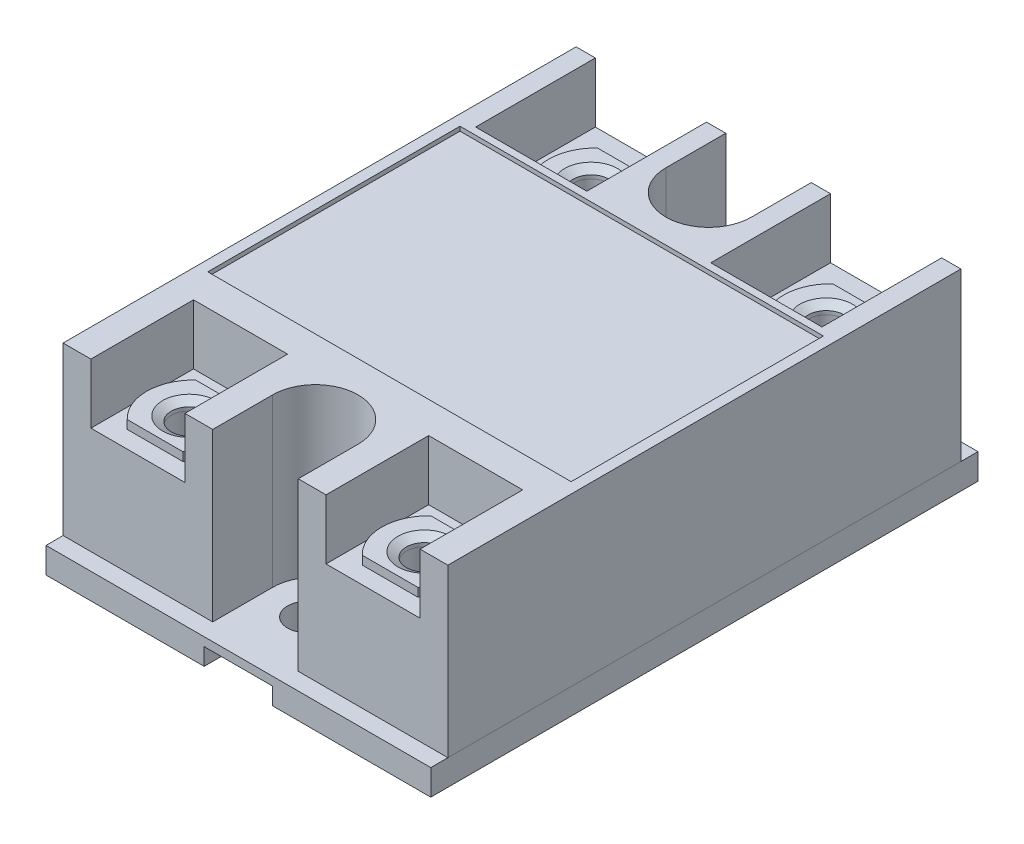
ISO-10303-21;
HEADER;
FILE_DESCRIPTION(('STEP AP214'),'2;1');
FILE_NAME('part.step','',(''),(''),'','','');
FILE_SCHEMA(('AUTOMOTIVE_DESIGN { 1 0 10303 214 1 1 1 1 }'));
ENDSEC;
DATA;
#1=APPLICATION_CONTEXT('core data for automotive mechanical design processes');
#2=APPLICATION_PROTOCOL_DEFINITION('international standard','automotive_design',2000,#1);
#3=PRODUCT_CONTEXT('',#1,'mechanical');
#4=PRODUCT('Part','Part','',(#3));
#5=PRODUCT_RELATED_PRODUCT_CATEGORY('part','',(#4));
#6=PRODUCT_DEFINITION_FORMATION('','',#4);
#7=PRODUCT_DEFINITION_CONTEXT('part definition',#1,'design');
#8=PRODUCT_DEFINITION('design','',#6,#7);
#9=PRODUCT_DEFINITION_SHAPE('','',#8);
#10=(LENGTH_UNIT() NAMED_UNIT(*) SI_UNIT(.MILLI.,.METRE.));
#11=(NAMED_UNIT(*) PLANE_ANGLE_UNIT() SI_UNIT($,.RADIAN.));
#12=(NAMED_UNIT(*) SI_UNIT($,.STERADIAN.) SOLID_ANGLE_UNIT());
#13=UNCERTAINTY_MEASURE_WITH_UNIT(LENGTH_MEASURE(1.E-05),#10,'distance_accuracy_value','');
#14=(GEOMETRIC_REPRESENTATION_CONTEXT(3) GLOBAL_UNCERTAINTY_ASSIGNED_CONTEXT((#13)) GLOBAL_UNIT_ASSIGNED_CONTEXT((#10,
#11,#12)) REPRESENTATION_CONTEXT('',''));
#15=CARTESIAN_POINT('',(0.,0.,0.));
#16=DIRECTION('',(0.,0.,1.));
#17=DIRECTION('',(1.,0.,0.));
#18=AXIS2_PLACEMENT_3D('',#15,#16,#17);
#19=CARTESIAN_POINT('',(36.7749172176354,13.5,-53.));
#20=DIRECTION('',(0.,1.,0.));
#21=DIRECTION('',(0.,0.,1.));
#22=AXIS2_PLACEMENT_3D('',#19,#20,#21);
#23=PLANE('',#22);
#24=CARTESIAN_POINT('',(36.25,13.5,-53.));
#25=DIRECTION('',(0.,1.,0.));
#26=DIRECTION('',(0.,0.,1.));
#27=AXIS2_PLACEMENT_3D('',#24,#25,#26);
#28=CIRCLE('',#27,3.10000000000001);
#29=CARTESIAN_POINT('',(36.25,13.5,-49.9));
#30=VERTEX_POINT('',#29);
#31=EDGE_CURVE('E12',#30,#30,#28,.F.);
#32=ORIENTED_EDGE('',*,*,#31,.T.);
#33=EDGE_LOOP('',(#32));
#34=FACE_BOUND('',#33,.T.);
#35=CARTESIAN_POINT('',(36.7749172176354,13.5,-53.));
#36=DIRECTION('',(0.,1.,0.));
#37=DIRECTION('',(0.,0.,1.));
#38=AXIS2_PLACEMENT_3D('',#35,#36,#37);
#39=CIRCLE('',#38,5.5);
#40=CARTESIAN_POINT('',(33.,13.5,-57.));
#41=VERTEX_POINT('',#40);
#42=CARTESIAN_POINT('',(33.,13.5,-49.));
#43=VERTEX_POINT('',#42);
#44=EDGE_CURVE('E101',#41,#43,#39,.T.);
#45=ORIENTED_EDGE('',*,*,#44,.T.);
#46=DIRECTION('',(1.,0.,0.));
#47=VECTOR('',#46,1.);
#48=CARTESIAN_POINT('',(33.,13.5,-49.));
#49=LINE('',#48,#47);
#50=CARTESIAN_POINT('',(39.5,13.5,-49.));
#51=VERTEX_POINT('',#50);
#52=EDGE_CURVE('E97',#43,#51,#49,.T.);
#53=ORIENTED_EDGE('',*,*,#52,.T.);
#54=CARTESIAN_POINT('',(35.7250827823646,13.5,-53.));
#55=DIRECTION('',(0.,1.,0.));
#56=DIRECTION('',(0.,0.,-1.));
#57=AXIS2_PLACEMENT_3D('',#54,#55,#56);
#58=CIRCLE('',#57,5.5);
#59=CARTESIAN_POINT('',(39.5,13.5,-57.));
#60=VERTEX_POINT('',#59);
#61=EDGE_CURVE('E99',#51,#60,#58,.T.);
#62=ORIENTED_EDGE('',*,*,#61,.T.);
#63=DIRECTION('',(-1.,0.,0.));
#64=VECTOR('',#63,1.);
#65=CARTESIAN_POINT('',(33.,13.5,-57.));
#66=LINE('',#65,#64);
#67=EDGE_CURVE('E66',#60,#41,#66,.T.);
#68=ORIENTED_EDGE('',*,*,#67,.T.);
#69=EDGE_LOOP('',(#45,#53,#62,#68));
#70=FACE_BOUND('',#69,.T.);
#71=ADVANCED_FACE('F49',(#34,#70),#23,.T.);
#72=CARTESIAN_POINT('',(36.7749172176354,12.5,-53.));
#73=DIRECTION('',(0.,1.,0.));
#74=DIRECTION('',(0.,0.,1.));
#75=AXIS2_PLACEMENT_3D('',#72,#73,#74);
#76=PLANE('',#75);
#77=CARTESIAN_POINT('',(36.7749172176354,12.5,-53.));
#78=DIRECTION('',(0.,1.,0.));
#79=DIRECTION('',(0.,0.,1.));
#80=AXIS2_PLACEMENT_3D('',#77,#78,#79);
#81=CIRCLE('',#80,5.5);
#82=CARTESIAN_POINT('',(33.,12.5,-57.));
#83=VERTEX_POINT('',#82);
#84=CARTESIAN_POINT('',(33.,12.5,-49.));
#85=VERTEX_POINT('',#84);
#86=EDGE_CURVE('E116',#83,#85,#81,.T.);
#87=ORIENTED_EDGE('',*,*,#86,.F.);
#88=DIRECTION('',(-1.,0.,0.));
#89=VECTOR('',#88,1.);
#90=CARTESIAN_POINT('',(33.,12.5,-57.));
#91=LINE('',#90,#89);
#92=CARTESIAN_POINT('',(39.5,12.5,-57.));
#93=VERTEX_POINT('',#92);
#94=EDGE_CURVE('E89',#93,#83,#91,.T.);
#95=ORIENTED_EDGE('',*,*,#94,.F.);
#96=CARTESIAN_POINT('',(35.7250827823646,12.5,-53.));
#97=DIRECTION('',(0.,1.,0.));
#98=DIRECTION('',(0.,0.,-1.));
#99=AXIS2_PLACEMENT_3D('',#96,#97,#98);
#100=CIRCLE('',#99,5.5);
#101=CARTESIAN_POINT('',(39.5,12.5,-49.));
#102=VERTEX_POINT('',#101);
#103=EDGE_CURVE('E83',#102,#93,#100,.T.);
#104=ORIENTED_EDGE('',*,*,#103,.F.);
#105=DIRECTION('',(1.,0.,0.));
#106=VECTOR('',#105,1.);
#107=CARTESIAN_POINT('',(33.,12.5,-49.));
#108=LINE('',#107,#106);
#109=EDGE_CURVE('E106',#85,#102,#108,.T.);
#110=ORIENTED_EDGE('',*,*,#109,.F.);
#111=EDGE_LOOP('',(#87,#95,#104,#110));
#112=FACE_BOUND('',#111,.T.);
#113=CARTESIAN_POINT('',(36.25,12.5,-53.));
#114=DIRECTION('',(0.,1.,0.));
#115=DIRECTION('',(0.,0.,1.));
#116=AXIS2_PLACEMENT_3D('',#113,#114,#115);
#117=CIRCLE('',#116,2.1);
#118=CARTESIAN_POINT('',(36.25,12.5,-50.9));
#119=VERTEX_POINT('',#118);
#120=EDGE_CURVE('E119',#119,#119,#117,.T.);
#121=ORIENTED_EDGE('',*,*,#120,.T.);
#122=EDGE_LOOP('',(#121));
#123=FACE_BOUND('',#122,.T.);
#124=ADVANCED_FACE('F140',(#112,#123),#76,.F.);
#125=CARTESIAN_POINT('',(36.7749172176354,13.5,-53.));
#126=DIRECTION('',(0.,-1.,0.));
#127=DIRECTION('',(0.,0.,-1.));
#128=AXIS2_PLACEMENT_3D('',#125,#126,#127);
#129=CYLINDRICAL_SURFACE('',#128,5.5);
#130=ORIENTED_EDGE('',*,*,#86,.T.);
#131=DIRECTION('',(0.,-1.,0.));
#132=VECTOR('',#131,1.);
#133=CARTESIAN_POINT('',(33.,13.5,-49.));
#134=LINE('',#133,#132);
#135=EDGE_CURVE('E107',#43,#85,#134,.T.);
#136=ORIENTED_EDGE('',*,*,#135,.F.);
#137=ORIENTED_EDGE('',*,*,#44,.F.);
#138=DIRECTION('',(0.,-1.,0.));
#139=VECTOR('',#138,1.);
#140=CARTESIAN_POINT('',(33.,13.5,-57.));
#141=LINE('',#140,#139);
#142=EDGE_CURVE('E112',#41,#83,#141,.T.);
#143=ORIENTED_EDGE('',*,*,#142,.T.);
#144=EDGE_LOOP('',(#130,#136,#137,#143));
#145=FACE_BOUND('',#144,.T.);
#146=ADVANCED_FACE('F146',(#145),#129,.T.);
#147=CARTESIAN_POINT('',(33.,13.5,-49.));
#148=DIRECTION('',(0.,0.,-1.));
#149=DIRECTION('',(-1.,0.,0.));
#150=AXIS2_PLACEMENT_3D('',#147,#148,#149);
#151=PLANE('',#150);
#152=ORIENTED_EDGE('',*,*,#109,.T.);
#153=DIRECTION('',(0.,-1.,0.));
#154=VECTOR('',#153,1.);
#155=CARTESIAN_POINT('',(39.5,13.5,-49.));
#156=LINE('',#155,#154);
#157=EDGE_CURVE('E104',#51,#102,#156,.T.);
#158=ORIENTED_EDGE('',*,*,#157,.F.);
#159=ORIENTED_EDGE('',*,*,#52,.F.);
#160=ORIENTED_EDGE('',*,*,#135,.T.);
#161=EDGE_LOOP('',(#152,#158,#159,#160));
#162=FACE_BOUND('',#161,.T.);
#163=ADVANCED_FACE('F105',(#162),#151,.F.);
#164=CARTESIAN_POINT('',(35.7250827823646,13.5,-53.));
#165=DIRECTION('',(0.,-1.,0.));
#166=DIRECTION('',(0.,0.,-1.));
#167=AXIS2_PLACEMENT_3D('',#164,#165,#166);
#168=CYLINDRICAL_SURFACE('',#167,5.5);
#169=ORIENTED_EDGE('',*,*,#103,.T.);
#170=DIRECTION('',(0.,-1.,0.));
#171=VECTOR('',#170,1.);
#172=CARTESIAN_POINT('',(39.5,13.5,-57.));
#173=LINE('',#172,#171);
#174=EDGE_CURVE('E108',#60,#93,#173,.T.);
#175=ORIENTED_EDGE('',*,*,#174,.F.);
#176=ORIENTED_EDGE('',*,*,#61,.F.);
#177=ORIENTED_EDGE('',*,*,#157,.T.);
#178=EDGE_LOOP('',(#169,#175,#176,#177));
#179=FACE_BOUND('',#178,.T.);
#180=ADVANCED_FACE('F110',(#179),#168,.T.);
#181=CARTESIAN_POINT('',(33.,13.5,-57.));
#182=DIRECTION('',(0.,0.,1.));
#183=DIRECTION('',(1.,0.,0.));
#184=AXIS2_PLACEMENT_3D('',#181,#182,#183);
#185=PLANE('',#184);
#186=ORIENTED_EDGE('',*,*,#94,.T.);
#187=ORIENTED_EDGE('',*,*,#142,.F.);
#188=ORIENTED_EDGE('',*,*,#67,.F.);
#189=ORIENTED_EDGE('',*,*,#174,.T.);
#190=EDGE_LOOP('',(#186,#187,#188,#189));
#191=FACE_BOUND('',#190,.T.);
#192=ADVANCED_FACE('F136',(#191),#185,.F.);
#193=CARTESIAN_POINT('',(36.25,13.5,-53.));
#194=DIRECTION('',(0.,-1.,0.));
#195=DIRECTION('',(0.,0.,-1.));
#196=AXIS2_PLACEMENT_3D('',#193,#194,#195);
#197=CYLINDRICAL_SURFACE('',#196,2.1);
#198=CARTESIAN_POINT('',(36.25,12.9226497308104,-53.));
#199=DIRECTION('',(0.,1.,0.));
#200=DIRECTION('',(0.,0.,1.));
#201=AXIS2_PLACEMENT_3D('',#198,#199,#200);
#202=CIRCLE('',#201,2.1);
#203=CARTESIAN_POINT('',(36.25,12.9226497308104,-50.9));
#204=VERTEX_POINT('',#203);
#205=EDGE_CURVE('E58',#204,#204,#202,.T.);
#206=ORIENTED_EDGE('',*,*,#205,.T.);
#207=EDGE_LOOP('',(#206));
#208=FACE_BOUND('',#207,.T.);
#209=ORIENTED_EDGE('',*,*,#120,.F.);
#210=EDGE_LOOP('',(#209));
#211=FACE_BOUND('',#210,.T.);
#212=ADVANCED_FACE('F128',(#208,#211),#197,.F.);
#213=CARTESIAN_POINT('',(36.25,12.9226497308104,-53.));
#214=DIRECTION('',(0.,1.,0.));
#215=DIRECTION('',(0.,0.,1.));
#216=AXIS2_PLACEMENT_3D('',#213,#214,#215);
#217=CONICAL_SURFACE('',#216,2.1,1.0471975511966);
#218=ORIENTED_EDGE('',*,*,#31,.F.);
#219=EDGE_LOOP('',(#218));
#220=FACE_BOUND('',#219,.T.);
#221=ORIENTED_EDGE('',*,*,#205,.F.);
#222=EDGE_LOOP('',(#221));
#223=FACE_BOUND('',#222,.T.);
#224=ADVANCED_FACE('F51',(#220,#223),#217,.F.);
#225=CLOSED_SHELL('',(#71,#124,#146,#163,#180,#192,#212,#224));
#226=MANIFOLD_SOLID_BREP('B2',#225);
#227=CARTESIAN_POINT('',(9.27491721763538,13.5,-53.));
#228=DIRECTION('',(0.,1.,0.));
#229=DIRECTION('',(0.,0.,1.));
#230=AXIS2_PLACEMENT_3D('',#227,#228,#229);
#231=PLANE('',#230);
#232=CARTESIAN_POINT('',(8.75,13.5,-53.));
#233=DIRECTION('',(0.,1.,0.));
#234=DIRECTION('',(0.,0.,1.));
#235=AXIS2_PLACEMENT_3D('',#232,#233,#234);
#236=CIRCLE('',#235,3.10000000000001);
#237=CARTESIAN_POINT('',(8.75,13.5,-49.9));
#238=VERTEX_POINT('',#237);
#239=EDGE_CURVE('E47',#238,#238,#236,.F.);
#240=ORIENTED_EDGE('',*,*,#239,.T.);
#241=EDGE_LOOP('',(#240));
#242=FACE_BOUND('',#241,.T.);
#243=CARTESIAN_POINT('',(9.27491721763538,13.5,-53.));
#244=DIRECTION('',(0.,1.,0.));
#245=DIRECTION('',(0.,0.,1.));
#246=AXIS2_PLACEMENT_3D('',#243,#244,#245);
#247=CIRCLE('',#246,5.5);
#248=CARTESIAN_POINT('',(5.5,13.5,-57.));
#249=VERTEX_POINT('',#248);
#250=CARTESIAN_POINT('',(5.5,13.5,-49.));
#251=VERTEX_POINT('',#250);
#252=EDGE_CURVE('E299',#249,#251,#247,.T.);
#253=ORIENTED_EDGE('',*,*,#252,.T.);
#254=DIRECTION('',(1.,0.,0.));
#255=VECTOR('',#254,1.);
#256=CARTESIAN_POINT('',(5.5,13.5,-49.));
#257=LINE('',#256,#255);
#258=CARTESIAN_POINT('',(12.,13.5,-49.));
#259=VERTEX_POINT('',#258);
#260=EDGE_CURVE('E295',#251,#259,#257,.T.);
#261=ORIENTED_EDGE('',*,*,#260,.T.);
#262=CARTESIAN_POINT('',(8.22508278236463,13.5,-53.));
#263=DIRECTION('',(0.,1.,0.));
#264=DIRECTION('',(0.,0.,-1.));
#265=AXIS2_PLACEMENT_3D('',#262,#263,#264);
#266=CIRCLE('',#265,5.5);
#267=CARTESIAN_POINT('',(12.,13.5,-57.));
#268=VERTEX_POINT('',#267);
#269=EDGE_CURVE('E297',#259,#268,#266,.T.);
#270=ORIENTED_EDGE('',*,*,#269,.T.);
#271=DIRECTION('',(-1.,0.,0.));
#272=VECTOR('',#271,1.);
#273=CARTESIAN_POINT('',(5.5,13.5,-57.));
#274=LINE('',#273,#272);
#275=EDGE_CURVE('E264',#268,#249,#274,.T.);
#276=ORIENTED_EDGE('',*,*,#275,.T.);
#277=EDGE_LOOP('',(#253,#261,#270,#276));
#278=FACE_BOUND('',#277,.T.);
#279=ADVANCED_FACE('F247',(#242,#278),#231,.T.);
#280=CARTESIAN_POINT('',(9.27491721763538,12.5,-53.));
#281=DIRECTION('',(0.,1.,0.));
#282=DIRECTION('',(0.,0.,1.));
#283=AXIS2_PLACEMENT_3D('',#280,#281,#282);
#284=PLANE('',#283);
#285=CARTESIAN_POINT('',(9.27491721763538,12.5,-53.));
#286=DIRECTION('',(0.,1.,0.));
#287=DIRECTION('',(0.,0.,1.));
#288=AXIS2_PLACEMENT_3D('',#285,#286,#287);
#289=CIRCLE('',#288,5.5);
#290=CARTESIAN_POINT('',(5.5,12.5,-57.));
#291=VERTEX_POINT('',#290);
#292=CARTESIAN_POINT('',(5.5,12.5,-49.));
#293=VERTEX_POINT('',#292);
#294=EDGE_CURVE('E314',#291,#293,#289,.T.);
#295=ORIENTED_EDGE('',*,*,#294,.F.);
#296=DIRECTION('',(-1.,0.,0.));
#297=VECTOR('',#296,1.);
#298=CARTESIAN_POINT('',(5.5,12.5,-57.));
#299=LINE('',#298,#297);
#300=CARTESIAN_POINT('',(12.,12.5,-57.));
#301=VERTEX_POINT('',#300);
#302=EDGE_CURVE('E287',#301,#291,#299,.T.);
#303=ORIENTED_EDGE('',*,*,#302,.F.);
#304=CARTESIAN_POINT('',(8.22508278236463,12.5,-53.));
#305=DIRECTION('',(0.,1.,0.));
#306=DIRECTION('',(0.,0.,-1.));
#307=AXIS2_PLACEMENT_3D('',#304,#305,#306);
#308=CIRCLE('',#307,5.5);
#309=CARTESIAN_POINT('',(12.,12.5,-49.));
#310=VERTEX_POINT('',#309);
#311=EDGE_CURVE('E281',#310,#301,#308,.T.);
#312=ORIENTED_EDGE('',*,*,#311,.F.);
#313=DIRECTION('',(1.,0.,0.));
#314=VECTOR('',#313,1.);
#315=CARTESIAN_POINT('',(5.5,12.5,-49.));
#316=LINE('',#315,#314);
#317=EDGE_CURVE('E304',#293,#310,#316,.T.);
#318=ORIENTED_EDGE('',*,*,#317,.F.);
#319=EDGE_LOOP('',(#295,#303,#312,#318));
#320=FACE_BOUND('',#319,.T.);
#321=CARTESIAN_POINT('',(8.75,12.5,-53.));
#322=DIRECTION('',(0.,1.,0.));
#323=DIRECTION('',(0.,0.,1.));
#324=AXIS2_PLACEMENT_3D('',#321,#322,#323);
#325=CIRCLE('',#324,2.1);
#326=CARTESIAN_POINT('',(8.75,12.5,-50.9));
#327=VERTEX_POINT('',#326);
#328=EDGE_CURVE('E317',#327,#327,#325,.T.);
#329=ORIENTED_EDGE('',*,*,#328,.T.);
#330=EDGE_LOOP('',(#329));
#331=FACE_BOUND('',#330,.T.);
#332=ADVANCED_FACE('F338',(#320,#331),#284,.F.);
#333=CARTESIAN_POINT('',(9.27491721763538,13.5,-53.));
#334=DIRECTION('',(0.,-1.,0.));
#335=DIRECTION('',(0.,0.,-1.));
#336=AXIS2_PLACEMENT_3D('',#333,#334,#335);
#337=CYLINDRICAL_SURFACE('',#336,5.5);
#338=ORIENTED_EDGE('',*,*,#294,.T.);
#339=DIRECTION('',(0.,-1.,0.));
#340=VECTOR('',#339,1.);
#341=CARTESIAN_POINT('',(5.5,13.5,-49.));
#342=LINE('',#341,#340);
#343=EDGE_CURVE('E305',#251,#293,#342,.T.);
#344=ORIENTED_EDGE('',*,*,#343,.F.);
#345=ORIENTED_EDGE('',*,*,#252,.F.);
#346=DIRECTION('',(0.,-1.,0.));
#347=VECTOR('',#346,1.);
#348=CARTESIAN_POINT('',(5.5,13.5,-57.));
#349=LINE('',#348,#347);
#350=EDGE_CURVE('E310',#249,#291,#349,.T.);
#351=ORIENTED_EDGE('',*,*,#350,.T.);
#352=EDGE_LOOP('',(#338,#344,#345,#351));
#353=FACE_BOUND('',#352,.T.);
#354=ADVANCED_FACE('F344',(#353),#337,.T.);
#355=CARTESIAN_POINT('',(5.5,13.5,-49.));
#356=DIRECTION('',(0.,0.,-1.));
#357=DIRECTION('',(-1.,0.,0.));
#358=AXIS2_PLACEMENT_3D('',#355,#356,#357);
#359=PLANE('',#358);
#360=ORIENTED_EDGE('',*,*,#317,.T.);
#361=DIRECTION('',(0.,-1.,0.));
#362=VECTOR('',#361,1.);
#363=CARTESIAN_POINT('',(12.,13.5,-49.));
#364=LINE('',#363,#362);
#365=EDGE_CURVE('E302',#259,#310,#364,.T.);
#366=ORIENTED_EDGE('',*,*,#365,.F.);
#367=ORIENTED_EDGE('',*,*,#260,.F.);
#368=ORIENTED_EDGE('',*,*,#343,.T.);
#369=EDGE_LOOP('',(#360,#366,#367,#368));
#370=FACE_BOUND('',#369,.T.);
#371=ADVANCED_FACE('F303',(#370),#359,.F.);
#372=CARTESIAN_POINT('',(8.22508278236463,13.5,-53.));
#373=DIRECTION('',(0.,-1.,0.));
#374=DIRECTION('',(0.,0.,-1.));
#375=AXIS2_PLACEMENT_3D('',#372,#373,#374);
#376=CYLINDRICAL_SURFACE('',#375,5.5);
#377=ORIENTED_EDGE('',*,*,#311,.T.);
#378=DIRECTION('',(0.,-1.,0.));
#379=VECTOR('',#378,1.);
#380=CARTESIAN_POINT('',(12.,13.5,-57.));
#381=LINE('',#380,#379);
#382=EDGE_CURVE('E306',#268,#301,#381,.T.);
#383=ORIENTED_EDGE('',*,*,#382,.F.);
#384=ORIENTED_EDGE('',*,*,#269,.F.);
#385=ORIENTED_EDGE('',*,*,#365,.T.);
#386=EDGE_LOOP('',(#377,#383,#384,#385));
#387=FACE_BOUND('',#386,.T.);
#388=ADVANCED_FACE('F308',(#387),#376,.T.);
#389=CARTESIAN_POINT('',(5.5,13.5,-57.));
#390=DIRECTION('',(0.,0.,1.));
#391=DIRECTION('',(1.,0.,0.));
#392=AXIS2_PLACEMENT_3D('',#389,#390,#391);
#393=PLANE('',#392);
#394=ORIENTED_EDGE('',*,*,#302,.T.);
#395=ORIENTED_EDGE('',*,*,#350,.F.);
#396=ORIENTED_EDGE('',*,*,#275,.F.);
#397=ORIENTED_EDGE('',*,*,#382,.T.);
#398=EDGE_LOOP('',(#394,#395,#396,#397));
#399=FACE_BOUND('',#398,.T.);
#400=ADVANCED_FACE('F334',(#399),#393,.F.);
#401=CARTESIAN_POINT('',(8.75,13.5,-53.));
#402=DIRECTION('',(0.,-1.,0.));
#403=DIRECTION('',(0.,0.,-1.));
#404=AXIS2_PLACEMENT_3D('',#401,#402,#403);
#405=CYLINDRICAL_SURFACE('',#404,2.1);
#406=CARTESIAN_POINT('',(8.75,12.9226497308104,-53.));
#407=DIRECTION('',(0.,1.,0.));
#408=DIRECTION('',(0.,0.,1.));
#409=AXIS2_PLACEMENT_3D('',#406,#407,#408);
#410=CIRCLE('',#409,2.1);
#411=CARTESIAN_POINT('',(8.75,12.9226497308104,-50.9));
#412=VERTEX_POINT('',#411);
#413=EDGE_CURVE('E256',#412,#412,#410,.T.);
#414=ORIENTED_EDGE('',*,*,#413,.T.);
#415=EDGE_LOOP('',(#414));
#416=FACE_BOUND('',#415,.T.);
#417=ORIENTED_EDGE('',*,*,#328,.F.);
#418=EDGE_LOOP('',(#417));
#419=FACE_BOUND('',#418,.T.);
#420=ADVANCED_FACE('F326',(#416,#419),#405,.F.);
#421=CARTESIAN_POINT('',(8.75,12.9226497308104,-53.));
#422=DIRECTION('',(0.,1.,0.));
#423=DIRECTION('',(0.,0.,1.));
#424=AXIS2_PLACEMENT_3D('',#421,#422,#423);
#425=CONICAL_SURFACE('',#424,2.1,1.0471975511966);
#426=ORIENTED_EDGE('',*,*,#239,.F.);
#427=EDGE_LOOP('',(#426));
#428=FACE_BOUND('',#427,.T.);
#429=ORIENTED_EDGE('',*,*,#413,.F.);
#430=EDGE_LOOP('',(#429));
#431=FACE_BOUND('',#430,.T.);
#432=ADVANCED_FACE('F249',(#428,#431),#425,.F.);
#433=CLOSED_SHELL('',(#279,#332,#354,#371,#388,#400,#420,#432));
#434=MANIFOLD_SOLID_BREP('B6',#433);
#435=CARTESIAN_POINT('',(36.7749172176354,13.5,-6.));
#436=DIRECTION('',(0.,1.,0.));
#437=DIRECTION('',(0.,0.,1.));
#438=AXIS2_PLACEMENT_3D('',#435,#436,#437);
#439=PLANE('',#438);
#440=CARTESIAN_POINT('',(36.25,13.5,-6.));
#441=DIRECTION('',(0.,1.,0.));
#442=DIRECTION('',(0.,0.,1.));
#443=AXIS2_PLACEMENT_3D('',#440,#441,#442);
#444=CIRCLE('',#443,3.10000000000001);
#445=CARTESIAN_POINT('',(36.25,13.5,-2.89999999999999));
#446=VERTEX_POINT('',#445);
#447=EDGE_CURVE('E245',#446,#446,#444,.F.);
#448=ORIENTED_EDGE('',*,*,#447,.T.);
#449=EDGE_LOOP('',(#448));
#450=FACE_BOUND('',#449,.T.);
#451=CARTESIAN_POINT('',(36.7749172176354,13.5,-6.));
#452=DIRECTION('',(0.,1.,0.));
#453=DIRECTION('',(0.,0.,1.));
#454=AXIS2_PLACEMENT_3D('',#451,#452,#453);
#455=CIRCLE('',#454,5.5);
#456=CARTESIAN_POINT('',(33.,13.5,-10.));
#457=VERTEX_POINT('',#456);
#458=CARTESIAN_POINT('',(33.,13.5,-2.));
#459=VERTEX_POINT('',#458);
#460=EDGE_CURVE('E497',#457,#459,#455,.T.);
#461=ORIENTED_EDGE('',*,*,#460,.T.);
#462=DIRECTION('',(1.,0.,0.));
#463=VECTOR('',#462,1.);
#464=CARTESIAN_POINT('',(33.,13.5,-2.));
#465=LINE('',#464,#463);
#466=CARTESIAN_POINT('',(39.5,13.5,-2.));
#467=VERTEX_POINT('',#466);
#468=EDGE_CURVE('E493',#459,#467,#465,.T.);
#469=ORIENTED_EDGE('',*,*,#468,.T.);
#470=CARTESIAN_POINT('',(35.7250827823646,13.5,-6.));
#471=DIRECTION('',(0.,1.,0.));
#472=DIRECTION('',(0.,0.,-1.));
#473=AXIS2_PLACEMENT_3D('',#470,#471,#472);
#474=CIRCLE('',#473,5.5);
#475=CARTESIAN_POINT('',(39.5,13.5,-10.));
#476=VERTEX_POINT('',#475);
#477=EDGE_CURVE('E495',#467,#476,#474,.T.);
#478=ORIENTED_EDGE('',*,*,#477,.T.);
#479=DIRECTION('',(-1.,0.,0.));
#480=VECTOR('',#479,1.);
#481=CARTESIAN_POINT('',(33.,13.5,-10.));
#482=LINE('',#481,#480);
#483=EDGE_CURVE('E462',#476,#457,#482,.T.);
#484=ORIENTED_EDGE('',*,*,#483,.T.);
#485=EDGE_LOOP('',(#461,#469,#478,#484));
#486=FACE_BOUND('',#485,.T.);
#487=ADVANCED_FACE('F445',(#450,#486),#439,.T.);
#488=CARTESIAN_POINT('',(36.7749172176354,12.5,-6.));
#489=DIRECTION('',(0.,1.,0.));
#490=DIRECTION('',(0.,0.,1.));
#491=AXIS2_PLACEMENT_3D('',#488,#489,#490);
#492=PLANE('',#491);
#493=CARTESIAN_POINT('',(36.7749172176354,12.5,-6.));
#494=DIRECTION('',(0.,1.,0.));
#495=DIRECTION('',(0.,0.,1.));
#496=AXIS2_PLACEMENT_3D('',#493,#494,#495);
#497=CIRCLE('',#496,5.5);
#498=CARTESIAN_POINT('',(33.,12.5,-10.));
#499=VERTEX_POINT('',#498);
#500=CARTESIAN_POINT('',(33.,12.5,-2.));
#501=VERTEX_POINT('',#500);
#502=EDGE_CURVE('E512',#499,#501,#497,.T.);
#503=ORIENTED_EDGE('',*,*,#502,.F.);
#504=DIRECTION('',(-1.,0.,0.));
#505=VECTOR('',#504,1.);
#506=CARTESIAN_POINT('',(33.,12.5,-10.));
#507=LINE('',#506,#505);
#508=CARTESIAN_POINT('',(39.5,12.5,-10.));
#509=VERTEX_POINT('',#508);
#510=EDGE_CURVE('E485',#509,#499,#507,.T.);
#511=ORIENTED_EDGE('',*,*,#510,.F.);
#512=CARTESIAN_POINT('',(35.7250827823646,12.5,-6.));
#513=DIRECTION('',(0.,1.,0.));
#514=DIRECTION('',(0.,0.,-1.));
#515=AXIS2_PLACEMENT_3D('',#512,#513,#514);
#516=CIRCLE('',#515,5.5);
#517=CARTESIAN_POINT('',(39.5,12.5,-2.));
#518=VERTEX_POINT('',#517);
#519=EDGE_CURVE('E479',#518,#509,#516,.T.);
#520=ORIENTED_EDGE('',*,*,#519,.F.);
#521=DIRECTION('',(1.,0.,0.));
#522=VECTOR('',#521,1.);
#523=CARTESIAN_POINT('',(33.,12.5,-2.));
#524=LINE('',#523,#522);
#525=EDGE_CURVE('E502',#501,#518,#524,.T.);
#526=ORIENTED_EDGE('',*,*,#525,.F.);
#527=EDGE_LOOP('',(#503,#511,#520,#526));
#528=FACE_BOUND('',#527,.T.);
#529=CARTESIAN_POINT('',(36.25,12.5,-6.));
#530=DIRECTION('',(0.,1.,0.));
#531=DIRECTION('',(0.,0.,1.));
#532=AXIS2_PLACEMENT_3D('',#529,#530,#531);
#533=CIRCLE('',#532,2.1);
#534=CARTESIAN_POINT('',(36.25,12.5,-3.9));
#535=VERTEX_POINT('',#534);
#536=EDGE_CURVE('E515',#535,#535,#533,.T.);
#537=ORIENTED_EDGE('',*,*,#536,.T.);
#538=EDGE_LOOP('',(#537));
#539=FACE_BOUND('',#538,.T.);
#540=ADVANCED_FACE('F536',(#528,#539),#492,.F.);
#541=CARTESIAN_POINT('',(36.7749172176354,13.5,-6.));
#542=DIRECTION('',(0.,-1.,0.));
#543=DIRECTION('',(0.,0.,-1.));
#544=AXIS2_PLACEMENT_3D('',#541,#542,#543);
#545=CYLINDRICAL_SURFACE('',#544,5.5);
#546=ORIENTED_EDGE('',*,*,#502,.T.);
#547=DIRECTION('',(0.,-1.,0.));
#548=VECTOR('',#547,1.);
#549=CARTESIAN_POINT('',(33.,13.5,-2.));
#550=LINE('',#549,#548);
#551=EDGE_CURVE('E503',#459,#501,#550,.T.);
#552=ORIENTED_EDGE('',*,*,#551,.F.);
#553=ORIENTED_EDGE('',*,*,#460,.F.);
#554=DIRECTION('',(0.,-1.,0.));
#555=VECTOR('',#554,1.);
#556=CARTESIAN_POINT('',(33.,13.5,-10.));
#557=LINE('',#556,#555);
#558=EDGE_CURVE('E508',#457,#499,#557,.T.);
#559=ORIENTED_EDGE('',*,*,#558,.T.);
#560=EDGE_LOOP('',(#546,#552,#553,#559));
#561=FACE_BOUND('',#560,.T.);
#562=ADVANCED_FACE('F542',(#561),#545,.T.);
#563=CARTESIAN_POINT('',(33.,13.5,-2.));
#564=DIRECTION('',(0.,0.,-1.));
#565=DIRECTION('',(-1.,0.,0.));
#566=AXIS2_PLACEMENT_3D('',#563,#564,#565);
#567=PLANE('',#566);
#568=ORIENTED_EDGE('',*,*,#525,.T.);
#569=DIRECTION('',(0.,-1.,0.));
#570=VECTOR('',#569,1.);
#571=CARTESIAN_POINT('',(39.5,13.5,-2.));
#572=LINE('',#571,#570);
#573=EDGE_CURVE('E500',#467,#518,#572,.T.);
#574=ORIENTED_EDGE('',*,*,#573,.F.);
#575=ORIENTED_EDGE('',*,*,#468,.F.);
#576=ORIENTED_EDGE('',*,*,#551,.T.);
#577=EDGE_LOOP('',(#568,#574,#575,#576));
#578=FACE_BOUND('',#577,.T.);
#579=ADVANCED_FACE('F501',(#578),#567,.F.);
#580=CARTESIAN_POINT('',(35.7250827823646,13.5,-6.));
#581=DIRECTION('',(0.,-1.,0.));
#582=DIRECTION('',(0.,0.,-1.));
#583=AXIS2_PLACEMENT_3D('',#580,#581,#582);
#584=CYLINDRICAL_SURFACE('',#583,5.5);
#585=ORIENTED_EDGE('',*,*,#519,.T.);
#586=DIRECTION('',(0.,-1.,0.));
#587=VECTOR('',#586,1.);
#588=CARTESIAN_POINT('',(39.5,13.5,-10.));
#589=LINE('',#588,#587);
#590=EDGE_CURVE('E504',#476,#509,#589,.T.);
#591=ORIENTED_EDGE('',*,*,#590,.F.);
#592=ORIENTED_EDGE('',*,*,#477,.F.);
#593=ORIENTED_EDGE('',*,*,#573,.T.);
#594=EDGE_LOOP('',(#585,#591,#592,#593));
#595=FACE_BOUND('',#594,.T.);
#596=ADVANCED_FACE('F506',(#595),#584,.T.);
#597=CARTESIAN_POINT('',(33.,13.5,-10.));
#598=DIRECTION('',(0.,0.,1.));
#599=DIRECTION('',(1.,0.,0.));
#600=AXIS2_PLACEMENT_3D('',#597,#598,#599);
#601=PLANE('',#600);
#602=ORIENTED_EDGE('',*,*,#510,.T.);
#603=ORIENTED_EDGE('',*,*,#558,.F.);
#604=ORIENTED_EDGE('',*,*,#483,.F.);
#605=ORIENTED_EDGE('',*,*,#590,.T.);
#606=EDGE_LOOP('',(#602,#603,#604,#605));
#607=FACE_BOUND('',#606,.T.);
#608=ADVANCED_FACE('F532',(#607),#601,.F.);
#609=CARTESIAN_POINT('',(36.25,13.5,-6.));
#610=DIRECTION('',(0.,-1.,0.));
#611=DIRECTION('',(0.,0.,-1.));
#612=AXIS2_PLACEMENT_3D('',#609,#610,#611);
#613=CYLINDRICAL_SURFACE('',#612,2.1);
#614=CARTESIAN_POINT('',(36.25,12.9226497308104,-6.));
#615=DIRECTION('',(0.,1.,0.));
#616=DIRECTION('',(0.,0.,1.));
#617=AXIS2_PLACEMENT_3D('',#614,#615,#616);
#618=CIRCLE('',#617,2.1);
#619=CARTESIAN_POINT('',(36.25,12.9226497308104,-3.9));
#620=VERTEX_POINT('',#619);
#621=EDGE_CURVE('E454',#620,#620,#618,.T.);
#622=ORIENTED_EDGE('',*,*,#621,.T.);
#623=EDGE_LOOP('',(#622));
#624=FACE_BOUND('',#623,.T.);
#625=ORIENTED_EDGE('',*,*,#536,.F.);
#626=EDGE_LOOP('',(#625));
#627=FACE_BOUND('',#626,.T.);
#628=ADVANCED_FACE('F524',(#624,#627),#613,.F.);
#629=CARTESIAN_POINT('',(36.25,12.9226497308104,-6.));
#630=DIRECTION('',(0.,1.,0.));
#631=DIRECTION('',(0.,0.,1.));
#632=AXIS2_PLACEMENT_3D('',#629,#630,#631);
#633=CONICAL_SURFACE('',#632,2.1,1.0471975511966);
#634=ORIENTED_EDGE('',*,*,#447,.F.);
#635=EDGE_LOOP('',(#634));
#636=FACE_BOUND('',#635,.T.);
#637=ORIENTED_EDGE('',*,*,#621,.F.);
#638=EDGE_LOOP('',(#637));
#639=FACE_BOUND('',#638,.T.);
#640=ADVANCED_FACE('F447',(#636,#639),#633,.F.);
#641=CLOSED_SHELL('',(#487,#540,#562,#579,#596,#608,#628,#640));
#642=MANIFOLD_SOLID_BREP('B41',#641);
#643=CARTESIAN_POINT('',(9.27491721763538,13.5,-6.));
#644=DIRECTION('',(0.,1.,0.));
#645=DIRECTION('',(0.,0.,1.));
#646=AXIS2_PLACEMENT_3D('',#643,#644,#645);
#647=PLANE('',#646);
#648=CARTESIAN_POINT('',(8.75,13.5,-6.));
#649=DIRECTION('',(0.,1.,0.));
#650=DIRECTION('',(0.,0.,1.));
#651=AXIS2_PLACEMENT_3D('',#648,#649,#650);
#652=CIRCLE('',#651,3.10000000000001);
#653=CARTESIAN_POINT('',(8.75,13.5,-2.89999999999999));
#654=VERTEX_POINT('',#653);
#655=EDGE_CURVE('E443',#654,#654,#652,.F.);
#656=ORIENTED_EDGE('',*,*,#655,.T.);
#657=EDGE_LOOP('',(#656));
#658=FACE_BOUND('',#657,.T.);
#659=CARTESIAN_POINT('',(9.27491721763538,13.5,-6.));
#660=DIRECTION('',(0.,1.,0.));
#661=DIRECTION('',(0.,0.,1.));
#662=AXIS2_PLACEMENT_3D('',#659,#660,#661);
#663=CIRCLE('',#662,5.5);
#664=CARTESIAN_POINT('',(5.5,13.5,-10.));
#665=VERTEX_POINT('',#664);
#666=CARTESIAN_POINT('',(5.5,13.5,-2.));
#667=VERTEX_POINT('',#666);
#668=EDGE_CURVE('E695',#665,#667,#663,.T.);
#669=ORIENTED_EDGE('',*,*,#668,.T.);
#670=DIRECTION('',(1.,0.,0.));
#671=VECTOR('',#670,1.);
#672=CARTESIAN_POINT('',(5.5,13.5,-2.));
#673=LINE('',#672,#671);
#674=CARTESIAN_POINT('',(12.,13.5,-2.));
#675=VERTEX_POINT('',#674);
#676=EDGE_CURVE('E691',#667,#675,#673,.T.);
#677=ORIENTED_EDGE('',*,*,#676,.T.);
#678=CARTESIAN_POINT('',(8.22508278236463,13.5,-6.));
#679=DIRECTION('',(0.,1.,0.));
#680=DIRECTION('',(0.,0.,-1.));
#681=AXIS2_PLACEMENT_3D('',#678,#679,#680);
#682=CIRCLE('',#681,5.5);
#683=CARTESIAN_POINT('',(12.,13.5,-10.));
#684=VERTEX_POINT('',#683);
#685=EDGE_CURVE('E693',#675,#684,#682,.T.);
#686=ORIENTED_EDGE('',*,*,#685,.T.);
#687=DIRECTION('',(-1.,0.,0.));
#688=VECTOR('',#687,1.);
#689=CARTESIAN_POINT('',(5.5,13.5,-10.));
#690=LINE('',#689,#688);
#691=EDGE_CURVE('E660',#684,#665,#690,.T.);
#692=ORIENTED_EDGE('',*,*,#691,.T.);
#693=EDGE_LOOP('',(#669,#677,#686,#692));
#694=FACE_BOUND('',#693,.T.);
#695=ADVANCED_FACE('F643',(#658,#694),#647,.T.);
#696=CARTESIAN_POINT('',(9.27491721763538,12.5,-6.));
#697=DIRECTION('',(0.,1.,0.));
#698=DIRECTION('',(0.,0.,1.));
#699=AXIS2_PLACEMENT_3D('',#696,#697,#698);
#700=PLANE('',#699);
#701=CARTESIAN_POINT('',(9.27491721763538,12.5,-6.));
#702=DIRECTION('',(0.,1.,0.));
#703=DIRECTION('',(0.,0.,1.));
#704=AXIS2_PLACEMENT_3D('',#701,#702,#703);
#705=CIRCLE('',#704,5.5);
#706=CARTESIAN_POINT('',(5.5,12.5,-10.));
#707=VERTEX_POINT('',#706);
#708=CARTESIAN_POINT('',(5.5,12.5,-2.));
#709=VERTEX_POINT('',#708);
#710=EDGE_CURVE('E710',#707,#709,#705,.T.);
#711=ORIENTED_EDGE('',*,*,#710,.F.);
#712=DIRECTION('',(-1.,0.,0.));
#713=VECTOR('',#712,1.);
#714=CARTESIAN_POINT('',(5.5,12.5,-10.));
#715=LINE('',#714,#713);
#716=CARTESIAN_POINT('',(12.,12.5,-10.));
#717=VERTEX_POINT('',#716);
#718=EDGE_CURVE('E683',#717,#707,#715,.T.);
#719=ORIENTED_EDGE('',*,*,#718,.F.);
#720=CARTESIAN_POINT('',(8.22508278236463,12.5,-6.));
#721=DIRECTION('',(0.,1.,0.));
#722=DIRECTION('',(0.,0.,-1.));
#723=AXIS2_PLACEMENT_3D('',#720,#721,#722);
#724=CIRCLE('',#723,5.5);
#725=CARTESIAN_POINT('',(12.,12.5,-2.));
#726=VERTEX_POINT('',#725);
#727=EDGE_CURVE('E677',#726,#717,#724,.T.);
#728=ORIENTED_EDGE('',*,*,#727,.F.);
#729=DIRECTION('',(1.,0.,0.));
#730=VECTOR('',#729,1.);
#731=CARTESIAN_POINT('',(5.5,12.5,-2.));
#732=LINE('',#731,#730);
#733=EDGE_CURVE('E700',#709,#726,#732,.T.);
#734=ORIENTED_EDGE('',*,*,#733,.F.);
#735=EDGE_LOOP('',(#711,#719,#728,#734));
#736=FACE_BOUND('',#735,.T.);
#737=CARTESIAN_POINT('',(8.75,12.5,-6.));
#738=DIRECTION('',(0.,1.,0.));
#739=DIRECTION('',(0.,0.,1.));
#740=AXIS2_PLACEMENT_3D('',#737,#738,#739);
#741=CIRCLE('',#740,2.1);
#742=CARTESIAN_POINT('',(8.75,12.5,-3.9));
#743=VERTEX_POINT('',#742);
#744=EDGE_CURVE('E713',#743,#743,#741,.T.);
#745=ORIENTED_EDGE('',*,*,#744,.T.);
#746=EDGE_LOOP('',(#745));
#747=FACE_BOUND('',#746,.T.);
#748=ADVANCED_FACE('F734',(#736,#747),#700,.F.);
#749=CARTESIAN_POINT('',(9.27491721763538,13.5,-6.));
#750=DIRECTION('',(0.,-1.,0.));
#751=DIRECTION('',(0.,0.,-1.));
#752=AXIS2_PLACEMENT_3D('',#749,#750,#751);
#753=CYLINDRICAL_SURFACE('',#752,5.5);
#754=ORIENTED_EDGE('',*,*,#710,.T.);
#755=DIRECTION('',(0.,-1.,0.));
#756=VECTOR('',#755,1.);
#757=CARTESIAN_POINT('',(5.5,13.5,-2.));
#758=LINE('',#757,#756);
#759=EDGE_CURVE('E701',#667,#709,#758,.T.);
#760=ORIENTED_EDGE('',*,*,#759,.F.);
#761=ORIENTED_EDGE('',*,*,#668,.F.);
#762=DIRECTION('',(0.,-1.,0.));
#763=VECTOR('',#762,1.);
#764=CARTESIAN_POINT('',(5.5,13.5,-10.));
#765=LINE('',#764,#763);
#766=EDGE_CURVE('E706',#665,#707,#765,.T.);
#767=ORIENTED_EDGE('',*,*,#766,.T.);
#768=EDGE_LOOP('',(#754,#760,#761,#767));
#769=FACE_BOUND('',#768,.T.);
#770=ADVANCED_FACE('F740',(#769),#753,.T.);
#771=CARTESIAN_POINT('',(5.5,13.5,-2.));
#772=DIRECTION('',(0.,0.,-1.));
#773=DIRECTION('',(-1.,0.,0.));
#774=AXIS2_PLACEMENT_3D('',#771,#772,#773);
#775=PLANE('',#774);
#776=ORIENTED_EDGE('',*,*,#733,.T.);
#777=DIRECTION('',(0.,-1.,0.));
#778=VECTOR('',#777,1.);
#779=CARTESIAN_POINT('',(12.,13.5,-2.));
#780=LINE('',#779,#778);
#781=EDGE_CURVE('E698',#675,#726,#780,.T.);
#782=ORIENTED_EDGE('',*,*,#781,.F.);
#783=ORIENTED_EDGE('',*,*,#676,.F.);
#784=ORIENTED_EDGE('',*,*,#759,.T.);
#785=EDGE_LOOP('',(#776,#782,#783,#784));
#786=FACE_BOUND('',#785,.T.);
#787=ADVANCED_FACE('F699',(#786),#775,.F.);
#788=CARTESIAN_POINT('',(8.22508278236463,13.5,-6.));
#789=DIRECTION('',(0.,-1.,0.));
#790=DIRECTION('',(0.,0.,-1.));
#791=AXIS2_PLACEMENT_3D('',#788,#789,#790);
#792=CYLINDRICAL_SURFACE('',#791,5.5);
#793=ORIENTED_EDGE('',*,*,#727,.T.);
#794=DIRECTION('',(0.,-1.,0.));
#795=VECTOR('',#794,1.);
#796=CARTESIAN_POINT('',(12.,13.5,-10.));
#797=LINE('',#796,#795);
#798=EDGE_CURVE('E702',#684,#717,#797,.T.);
#799=ORIENTED_EDGE('',*,*,#798,.F.);
#800=ORIENTED_EDGE('',*,*,#685,.F.);
#801=ORIENTED_EDGE('',*,*,#781,.T.);
#802=EDGE_LOOP('',(#793,#799,#800,#801));
#803=FACE_BOUND('',#802,.T.);
#804=ADVANCED_FACE('F704',(#803),#792,.T.);
#805=CARTESIAN_POINT('',(5.5,13.5,-10.));
#806=DIRECTION('',(0.,0.,1.));
#807=DIRECTION('',(1.,0.,0.));
#808=AXIS2_PLACEMENT_3D('',#805,#806,#807);
#809=PLANE('',#808);
#810=ORIENTED_EDGE('',*,*,#718,.T.);
#811=ORIENTED_EDGE('',*,*,#766,.F.);
#812=ORIENTED_EDGE('',*,*,#691,.F.);
#813=ORIENTED_EDGE('',*,*,#798,.T.);
#814=EDGE_LOOP('',(#810,#811,#812,#813));
#815=FACE_BOUND('',#814,.T.);
#816=ADVANCED_FACE('F730',(#815),#809,.F.);
#817=CARTESIAN_POINT('',(8.75,13.5,-6.));
#818=DIRECTION('',(0.,-1.,0.));
#819=DIRECTION('',(0.,0.,-1.));
#820=AXIS2_PLACEMENT_3D('',#817,#818,#819);
#821=CYLINDRICAL_SURFACE('',#820,2.1);
#822=CARTESIAN_POINT('',(8.75,12.9226497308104,-6.));
#823=DIRECTION('',(0.,1.,0.));
#824=DIRECTION('',(0.,0.,1.));
#825=AXIS2_PLACEMENT_3D('',#822,#823,#824);
#826=CIRCLE('',#825,2.1);
#827=CARTESIAN_POINT('',(8.75,12.9226497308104,-3.9));
#828=VERTEX_POINT('',#827);
#829=EDGE_CURVE('E652',#828,#828,#826,.T.);
#830=ORIENTED_EDGE('',*,*,#829,.T.);
#831=EDGE_LOOP('',(#830));
#832=FACE_BOUND('',#831,.T.);
#833=ORIENTED_EDGE('',*,*,#744,.F.);
#834=EDGE_LOOP('',(#833));
#835=FACE_BOUND('',#834,.T.);
#836=ADVANCED_FACE('F722',(#832,#835),#821,.F.);
#837=CARTESIAN_POINT('',(8.75,12.9226497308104,-6.));
#838=DIRECTION('',(0.,1.,0.));
#839=DIRECTION('',(0.,0.,1.));
#840=AXIS2_PLACEMENT_3D('',#837,#838,#839);
#841=CONICAL_SURFACE('',#840,2.1,1.0471975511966);
#842=ORIENTED_EDGE('',*,*,#655,.F.);
#843=EDGE_LOOP('',(#842));
#844=FACE_BOUND('',#843,.T.);
#845=ORIENTED_EDGE('',*,*,#829,.F.);
#846=EDGE_LOOP('',(#845));
#847=FACE_BOUND('',#846,.T.);
#848=ADVANCED_FACE('F645',(#844,#847),#841,.F.);
#849=CLOSED_SHELL('',(#695,#748,#770,#787,#804,#816,#836,#848));
#850=MANIFOLD_SOLID_BREP('B239',#849);
#851=CARTESIAN_POINT('',(0.,-3.,2.));
#852=DIRECTION('',(-1.,0.,0.));
#853=DIRECTION('',(0.,0.,1.));
#854=AXIS2_PLACEMENT_3D('',#851,#852,#853);
#855=PLANE('',#854);
#856=DIRECTION('',(0.,0.,1.));
#857=VECTOR('',#856,1.);
#858=CARTESIAN_POINT('',(0.,0.,2.));
#859=LINE('',#858,#857);
#860=CARTESIAN_POINT('',(0.,0.,-62.));
#861=VERTEX_POINT('',#860);
#862=CARTESIAN_POINT('',(0.,0.,2.));
#863=VERTEX_POINT('',#862);
#864=EDGE_CURVE('E1042',#861,#863,#859,.T.);
#865=ORIENTED_EDGE('',*,*,#864,.F.);
#866=DIRECTION('',(0.,1.,0.));
#867=VECTOR('',#866,1.);
#868=CARTESIAN_POINT('',(0.,-3.,-62.));
#869=LINE('',#868,#867);
#870=CARTESIAN_POINT('',(0.,-3.,-62.));
#871=VERTEX_POINT('',#870);
#872=EDGE_CURVE('E641',#871,#861,#869,.T.);
#873=ORIENTED_EDGE('',*,*,#872,.F.);
#874=DIRECTION('',(0.,0.,1.));
#875=VECTOR('',#874,1.);
#876=CARTESIAN_POINT('',(0.,-3.,2.));
#877=LINE('',#876,#875);
#878=CARTESIAN_POINT('',(0.,-3.,2.));
#879=VERTEX_POINT('',#878);
#880=EDGE_CURVE('E1045',#871,#879,#877,.T.);
#881=ORIENTED_EDGE('',*,*,#880,.T.);
#882=DIRECTION('',(0.,1.,0.));
#883=VECTOR('',#882,1.);
#884=CARTESIAN_POINT('',(0.,-3.,2.));
#885=LINE('',#884,#883);
#886=EDGE_CURVE('E1060',#879,#863,#885,.T.);
#887=ORIENTED_EDGE('',*,*,#886,.T.);
#888=EDGE_LOOP('',(#865,#873,#881,#887));
#889=FACE_BOUND('',#888,.T.);
#890=ADVANCED_FACE('F811',(#889),#855,.T.);
#891=CARTESIAN_POINT('',(0.,-3.,-62.));
#892=DIRECTION('',(0.,0.,-1.));
#893=DIRECTION('',(-1.,0.,0.));
#894=AXIS2_PLACEMENT_3D('',#891,#892,#893);
#895=PLANE('',#894);
#896=DIRECTION('',(0.,-1.,0.));
#897=VECTOR('',#896,1.);
#898=CARTESIAN_POINT('',(26.5,-1.,-62.));
#899=LINE('',#898,#897);
#900=CARTESIAN_POINT('',(26.5,-1.,-62.));
#901=VERTEX_POINT('',#900);
#902=CARTESIAN_POINT('',(26.5,-3.,-62.));
#903=VERTEX_POINT('',#902);
#904=EDGE_CURVE('E962',#901,#903,#899,.T.);
#905=ORIENTED_EDGE('',*,*,#904,.F.);
#906=DIRECTION('',(1.,0.,0.));
#907=VECTOR('',#906,1.);
#908=CARTESIAN_POINT('',(26.5,-1.,-62.));
#909=LINE('',#908,#907);
#910=CARTESIAN_POINT('',(18.5,-1.,-62.));
#911=VERTEX_POINT('',#910);
#912=EDGE_CURVE('E940',#911,#901,#909,.T.);
#913=ORIENTED_EDGE('',*,*,#912,.F.);
#914=DIRECTION('',(0.,-1.,0.));
#915=VECTOR('',#914,1.);
#916=CARTESIAN_POINT('',(18.5,-1.,-62.));
#917=LINE('',#916,#915);
#918=CARTESIAN_POINT('',(18.5,-3.,-62.));
#919=VERTEX_POINT('',#918);
#920=EDGE_CURVE('E964',#911,#919,#917,.T.);
#921=ORIENTED_EDGE('',*,*,#920,.T.);
#922=DIRECTION('',(-1.,0.,0.));
#923=VECTOR('',#922,1.);
#924=CARTESIAN_POINT('',(0.,-3.,-62.));
#925=LINE('',#924,#923);
#926=EDGE_CURVE('E1056',#919,#871,#925,.T.);
#927=ORIENTED_EDGE('',*,*,#926,.T.);
#928=ORIENTED_EDGE('',*,*,#872,.T.);
#929=DIRECTION('',(-1.,0.,0.));
#930=VECTOR('',#929,1.);
#931=CARTESIAN_POINT('',(0.,0.,-62.));
#932=LINE('',#931,#930);
#933=CARTESIAN_POINT('',(45.,0.,-62.));
#934=VERTEX_POINT('',#933);
#935=EDGE_CURVE('E1049',#934,#861,#932,.T.);
#936=ORIENTED_EDGE('',*,*,#935,.F.);
#937=DIRECTION('',(0.,1.,0.));
#938=VECTOR('',#937,1.);
#939=CARTESIAN_POINT('',(45.,-3.,-62.));
#940=LINE('',#939,#938);
#941=CARTESIAN_POINT('',(45.,-3.,-62.));
#942=VERTEX_POINT('',#941);
#943=EDGE_CURVE('E819',#942,#934,#940,.T.);
#944=ORIENTED_EDGE('',*,*,#943,.F.);
#945=EDGE_CURVE('E1057',#942,#903,#925,.T.);
#946=ORIENTED_EDGE('',*,*,#945,.T.);
#947=EDGE_LOOP('',(#905,#913,#921,#927,#928,#936,#944,#946));
#948=FACE_BOUND('',#947,.T.);
#949=ADVANCED_FACE('F1101',(#948),#895,.T.);
#950=CARTESIAN_POINT('',(45.,-3.,2.));
#951=DIRECTION('',(1.,0.,0.));
#952=DIRECTION('',(0.,0.,-1.));
#953=AXIS2_PLACEMENT_3D('',#950,#951,#952);
#954=PLANE('',#953);
#955=DIRECTION('',(0.,0.,-1.));
#956=VECTOR('',#955,1.);
#957=CARTESIAN_POINT('',(45.,0.,2.));
#958=LINE('',#957,#956);
#959=CARTESIAN_POINT('',(45.,0.,2.));
#960=VERTEX_POINT('',#959);
#961=EDGE_CURVE('E1066',#960,#934,#958,.T.);
#962=ORIENTED_EDGE('',*,*,#961,.F.);
#963=DIRECTION('',(0.,1.,0.));
#964=VECTOR('',#963,1.);
#965=CARTESIAN_POINT('',(45.,-3.,2.));
#966=LINE('',#965,#964);
#967=CARTESIAN_POINT('',(45.,-3.,2.));
#968=VERTEX_POINT('',#967);
#969=EDGE_CURVE('E1072',#968,#960,#966,.T.);
#970=ORIENTED_EDGE('',*,*,#969,.F.);
#971=DIRECTION('',(0.,0.,-1.));
#972=VECTOR('',#971,1.);
#973=CARTESIAN_POINT('',(45.,-3.,2.));
#974=LINE('',#973,#972);
#975=EDGE_CURVE('E1053',#968,#942,#974,.T.);
#976=ORIENTED_EDGE('',*,*,#975,.T.);
#977=ORIENTED_EDGE('',*,*,#943,.T.);
#978=EDGE_LOOP('',(#962,#970,#976,#977));
#979=FACE_BOUND('',#978,.T.);
#980=ADVANCED_FACE('F1106',(#979),#954,.T.);
#981=CARTESIAN_POINT('',(0.,-3.,2.));
#982=DIRECTION('',(0.,0.,1.));
#983=DIRECTION('',(1.,0.,0.));
#984=AXIS2_PLACEMENT_3D('',#981,#982,#983);
#985=PLANE('',#984);
#986=DIRECTION('',(0.,-1.,0.));
#987=VECTOR('',#986,1.);
#988=CARTESIAN_POINT('',(18.5,-1.,2.));
#989=LINE('',#988,#987);
#990=CARTESIAN_POINT('',(18.5,-1.,2.));
#991=VERTEX_POINT('',#990);
#992=CARTESIAN_POINT('',(18.5,-3.,2.));
#993=VERTEX_POINT('',#992);
#994=EDGE_CURVE('E987',#991,#993,#989,.T.);
#995=ORIENTED_EDGE('',*,*,#994,.F.);
#996=DIRECTION('',(-1.,0.,0.));
#997=VECTOR('',#996,1.);
#998=CARTESIAN_POINT('',(18.5,-1.,2.));
#999=LINE('',#998,#997);
#1000=CARTESIAN_POINT('',(26.5,-1.,2.));
#1001=VERTEX_POINT('',#1000);
#1002=EDGE_CURVE('E978',#1001,#991,#999,.T.);
#1003=ORIENTED_EDGE('',*,*,#1002,.F.);
#1004=DIRECTION('',(0.,-1.,0.));
#1005=VECTOR('',#1004,1.);
#1006=CARTESIAN_POINT('',(26.5,-1.,2.));
#1007=LINE('',#1006,#1005);
#1008=CARTESIAN_POINT('',(26.5,-3.,2.));
#1009=VERTEX_POINT('',#1008);
#1010=EDGE_CURVE('E990',#1001,#1009,#1007,.T.);
#1011=ORIENTED_EDGE('',*,*,#1010,.T.);
#1012=DIRECTION('',(1.,0.,0.));
#1013=VECTOR('',#1012,1.);
#1014=CARTESIAN_POINT('',(0.,-3.,2.));
#1015=LINE('',#1014,#1013);
#1016=EDGE_CURVE('E1048',#1009,#968,#1015,.T.);
#1017=ORIENTED_EDGE('',*,*,#1016,.T.);
#1018=ORIENTED_EDGE('',*,*,#969,.T.);
#1019=DIRECTION('',(1.,0.,0.));
#1020=VECTOR('',#1019,1.);
#1021=CARTESIAN_POINT('',(0.,0.,2.));
#1022=LINE('',#1021,#1020);
#1023=EDGE_CURVE('E1063',#863,#960,#1022,.T.);
#1024=ORIENTED_EDGE('',*,*,#1023,.F.);
#1025=ORIENTED_EDGE('',*,*,#886,.F.);
#1026=EDGE_CURVE('E1050',#879,#993,#1015,.T.);
#1027=ORIENTED_EDGE('',*,*,#1026,.T.);
#1028=EDGE_LOOP('',(#995,#1003,#1011,#1017,#1018,#1024,#1025,#1027));
#1029=FACE_BOUND('',#1028,.T.);
#1030=ADVANCED_FACE('F1125',(#1029),#985,.T.);
#1031=CARTESIAN_POINT('',(0.,-3.,0.));
#1032=DIRECTION('',(0.,-1.,0.));
#1033=DIRECTION('',(0.,0.,-1.));
#1034=AXIS2_PLACEMENT_3D('',#1031,#1032,#1033);
#1035=PLANE('',#1034);
#1036=DIRECTION('',(0.,0.,1.));
#1037=VECTOR('',#1036,1.);
#1038=CARTESIAN_POINT('',(26.5,-3.,-59.));
#1039=LINE('',#1038,#1037);
#1040=CARTESIAN_POINT('',(26.5,-3.,-59.));
#1041=VERTEX_POINT('',#1040);
#1042=EDGE_CURVE('E827',#903,#1041,#1039,.T.);
#1043=ORIENTED_EDGE('',*,*,#1042,.F.);
#1044=ORIENTED_EDGE('',*,*,#945,.F.);
#1045=ORIENTED_EDGE('',*,*,#975,.F.);
#1046=ORIENTED_EDGE('',*,*,#1016,.F.);
#1047=DIRECTION('',(0.,0.,1.));
#1048=VECTOR('',#1047,1.);
#1049=CARTESIAN_POINT('',(26.5,-3.,2.));
#1050=LINE('',#1049,#1048);
#1051=CARTESIAN_POINT('',(26.5,-3.,-1.));
#1052=VERTEX_POINT('',#1051);
#1053=EDGE_CURVE('E972',#1052,#1009,#1050,.T.);
#1054=ORIENTED_EDGE('',*,*,#1053,.F.);
#1055=DIRECTION('',(1.,0.,0.));
#1056=VECTOR('',#1055,1.);
#1057=CARTESIAN_POINT('',(18.5,-3.,-1.));
#1058=LINE('',#1057,#1056);
#1059=CARTESIAN_POINT('',(18.5,-3.,-1.));
#1060=VERTEX_POINT('',#1059);
#1061=EDGE_CURVE('E983',#1060,#1052,#1058,.T.);
#1062=ORIENTED_EDGE('',*,*,#1061,.F.);
#1063=DIRECTION('',(0.,0.,-1.));
#1064=VECTOR('',#1063,1.);
#1065=CARTESIAN_POINT('',(18.5,-3.,2.));
#1066=LINE('',#1065,#1064);
#1067=EDGE_CURVE('E835',#993,#1060,#1066,.T.);
#1068=ORIENTED_EDGE('',*,*,#1067,.F.);
#1069=ORIENTED_EDGE('',*,*,#1026,.F.);
#1070=ORIENTED_EDGE('',*,*,#880,.F.);
#1071=ORIENTED_EDGE('',*,*,#926,.F.);
#1072=DIRECTION('',(0.,0.,-1.));
#1073=VECTOR('',#1072,1.);
#1074=CARTESIAN_POINT('',(18.5,-3.,-59.));
#1075=LINE('',#1074,#1073);
#1076=CARTESIAN_POINT('',(18.5,-3.,-59.));
#1077=VERTEX_POINT('',#1076);
#1078=EDGE_CURVE('E953',#1077,#919,#1075,.T.);
#1079=ORIENTED_EDGE('',*,*,#1078,.F.);
#1080=DIRECTION('',(-1.,0.,0.));
#1081=VECTOR('',#1080,1.);
#1082=CARTESIAN_POINT('',(26.5,-3.,-59.));
#1083=LINE('',#1082,#1081);
#1084=EDGE_CURVE('E955',#1041,#1077,#1083,.T.);
#1085=ORIENTED_EDGE('',*,*,#1084,.F.);
#1086=EDGE_LOOP('',(#1043,#1044,#1045,#1046,#1054,#1062,#1068,#1069,#1070,#1071,#1079,#1085));
#1087=FACE_BOUND('',#1086,.T.);
#1088=CARTESIAN_POINT('',(22.5,-3.,-55.5));
#1089=DIRECTION('',(0.,1.,0.));
#1090=DIRECTION('',(0.,0.,1.));
#1091=AXIS2_PLACEMENT_3D('',#1088,#1089,#1090);
#1092=CIRCLE('',#1091,2.25);
#1093=CARTESIAN_POINT('',(24.75,-3.,-55.5));
#1094=VERTEX_POINT('',#1093);
#1095=CARTESIAN_POINT('',(20.25,-3.,-55.5));
#1096=VERTEX_POINT('',#1095);
#1097=EDGE_CURVE('E1006',#1094,#1096,#1092,.T.);
#1098=ORIENTED_EDGE('',*,*,#1097,.T.);
#1099=DIRECTION('',(0.,0.,1.));
#1100=VECTOR('',#1099,1.);
#1101=CARTESIAN_POINT('',(20.25,-3.,-55.5));
#1102=LINE('',#1101,#1100);
#1103=CARTESIAN_POINT('',(20.25,-3.,-54.));
#1104=VERTEX_POINT('',#1103);
#1105=EDGE_CURVE('E1009',#1096,#1104,#1102,.T.);
#1106=ORIENTED_EDGE('',*,*,#1105,.T.);
#1107=CARTESIAN_POINT('',(22.5,-3.,-54.));
#1108=DIRECTION('',(0.,1.,0.));
#1109=DIRECTION('',(0.,0.,1.));
#1110=AXIS2_PLACEMENT_3D('',#1107,#1108,#1109);
#1111=CIRCLE('',#1110,2.25);
#1112=CARTESIAN_POINT('',(24.75,-3.,-54.));
#1113=VERTEX_POINT('',#1112);
#1114=EDGE_CURVE('E1013',#1104,#1113,#1111,.T.);
#1115=ORIENTED_EDGE('',*,*,#1114,.T.);
#1116=DIRECTION('',(0.,0.,-1.));
#1117=VECTOR('',#1116,1.);
#1118=CARTESIAN_POINT('',(24.75,-3.,-55.5));
#1119=LINE('',#1118,#1117);
#1120=EDGE_CURVE('E1016',#1113,#1094,#1119,.T.);
#1121=ORIENTED_EDGE('',*,*,#1120,.T.);
#1122=EDGE_LOOP('',(#1098,#1106,#1115,#1121));
#1123=FACE_BOUND('',#1122,.T.);
#1124=CARTESIAN_POINT('',(22.5,-3.,-6.));
#1125=DIRECTION('',(0.,1.,0.));
#1126=DIRECTION('',(0.,0.,1.));
#1127=AXIS2_PLACEMENT_3D('',#1124,#1125,#1126);
#1128=CIRCLE('',#1127,2.25);
#1129=CARTESIAN_POINT('',(22.5,-3.,-3.75));
#1130=VERTEX_POINT('',#1129);
#1131=EDGE_CURVE('E1039',#1130,#1130,#1128,.T.);
#1132=ORIENTED_EDGE('',*,*,#1131,.T.);
#1133=EDGE_LOOP('',(#1132));
#1134=FACE_BOUND('',#1133,.T.);
#1135=ADVANCED_FACE('F1119',(#1087,#1123,#1134),#1035,.T.);
#1136=CARTESIAN_POINT('',(0.,0.,0.));
#1137=DIRECTION('',(0.,-1.,0.));
#1138=DIRECTION('',(0.,0.,-1.));
#1139=AXIS2_PLACEMENT_3D('',#1136,#1137,#1138);
#1140=PLANE('',#1139);
#1141=CARTESIAN_POINT('',(8.75,0.,-53.));
#1142=DIRECTION('',(0.,-1.,0.));
#1143=DIRECTION('',(0.,0.,-1.));
#1144=AXIS2_PLACEMENT_3D('',#1141,#1142,#1143);
#1145=CIRCLE('',#1144,2.09999999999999);
#1146=CARTESIAN_POINT('',(8.75,0.,-55.1));
#1147=VERTEX_POINT('',#1146);
#1148=EDGE_CURVE('E814',#1147,#1147,#1145,.T.);
#1149=ORIENTED_EDGE('',*,*,#1148,.T.);
#1150=EDGE_LOOP('',(#1149));
#1151=FACE_BOUND('',#1150,.T.);
#1152=CARTESIAN_POINT('',(8.75,0.,-6.));
#1153=DIRECTION('',(0.,-1.,0.));
#1154=DIRECTION('',(0.,0.,-1.));
#1155=AXIS2_PLACEMENT_3D('',#1152,#1153,#1154);
#1156=CIRCLE('',#1155,2.09999999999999);
#1157=CARTESIAN_POINT('',(8.75,0.,-8.09999999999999));
#1158=VERTEX_POINT('',#1157);
#1159=EDGE_CURVE('E1001',#1158,#1158,#1156,.T.);
#1160=ORIENTED_EDGE('',*,*,#1159,.T.);
#1161=EDGE_LOOP('',(#1160));
#1162=FACE_BOUND('',#1161,.T.);
#1163=CARTESIAN_POINT('',(36.25,0.,-53.));
#1164=DIRECTION('',(0.,-1.,0.));
#1165=DIRECTION('',(0.,0.,-1.));
#1166=AXIS2_PLACEMENT_3D('',#1163,#1164,#1165);
#1167=CIRCLE('',#1166,2.09999999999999);
#1168=CARTESIAN_POINT('',(36.25,0.,-55.1));
#1169=VERTEX_POINT('',#1168);
#1170=EDGE_CURVE('E1005',#1169,#1169,#1167,.T.);
#1171=ORIENTED_EDGE('',*,*,#1170,.T.);
#1172=EDGE_LOOP('',(#1171));
#1173=FACE_BOUND('',#1172,.T.);
#1174=DIRECTION('',(0.,0.,1.));
#1175=VECTOR('',#1174,1.);
#1176=CARTESIAN_POINT('',(20.25,0.,-55.5));
#1177=LINE('',#1176,#1175);
#1178=CARTESIAN_POINT('',(20.25,0.,-55.5));
#1179=VERTEX_POINT('',#1178);
#1180=CARTESIAN_POINT('',(20.25,0.,-54.));
#1181=VERTEX_POINT('',#1180);
#1182=EDGE_CURVE('E1022',#1179,#1181,#1177,.T.);
#1183=ORIENTED_EDGE('',*,*,#1182,.F.);
#1184=CARTESIAN_POINT('',(22.5,0.,-55.5));
#1185=DIRECTION('',(0.,1.,0.));
#1186=DIRECTION('',(0.,0.,1.));
#1187=AXIS2_PLACEMENT_3D('',#1184,#1185,#1186);
#1188=CIRCLE('',#1187,2.25);
#1189=CARTESIAN_POINT('',(24.75,0.,-55.5));
#1190=VERTEX_POINT('',#1189);
#1191=EDGE_CURVE('E1020',#1190,#1179,#1188,.T.);
#1192=ORIENTED_EDGE('',*,*,#1191,.F.);
#1193=DIRECTION('',(0.,0.,-1.));
#1194=VECTOR('',#1193,1.);
#1195=CARTESIAN_POINT('',(24.75,0.,-55.5));
#1196=LINE('',#1195,#1194);
#1197=CARTESIAN_POINT('',(24.75,0.,-54.));
#1198=VERTEX_POINT('',#1197);
#1199=EDGE_CURVE('E1010',#1198,#1190,#1196,.T.);
#1200=ORIENTED_EDGE('',*,*,#1199,.F.);
#1201=CARTESIAN_POINT('',(22.5,0.,-54.));
#1202=DIRECTION('',(0.,1.,0.));
#1203=DIRECTION('',(0.,0.,1.));
#1204=AXIS2_PLACEMENT_3D('',#1201,#1202,#1203);
#1205=CIRCLE('',#1204,2.25);
#1206=EDGE_CURVE('E1025',#1181,#1198,#1205,.T.);
#1207=ORIENTED_EDGE('',*,*,#1206,.F.);
#1208=EDGE_LOOP('',(#1183,#1192,#1200,#1207));
#1209=FACE_BOUND('',#1208,.T.);
#1210=CARTESIAN_POINT('',(22.5,0.,-6.));
#1211=DIRECTION('',(0.,1.,0.));
#1212=DIRECTION('',(0.,0.,1.));
#1213=AXIS2_PLACEMENT_3D('',#1210,#1211,#1212);
#1214=CIRCLE('',#1213,2.25);
#1215=CARTESIAN_POINT('',(22.5,0.,-3.75));
#1216=VERTEX_POINT('',#1215);
#1217=EDGE_CURVE('E1032',#1216,#1216,#1214,.T.);
#1218=ORIENTED_EDGE('',*,*,#1217,.F.);
#1219=EDGE_LOOP('',(#1218));
#1220=FACE_BOUND('',#1219,.T.);
#1221=ORIENTED_EDGE('',*,*,#864,.T.);
#1222=ORIENTED_EDGE('',*,*,#1023,.T.);
#1223=ORIENTED_EDGE('',*,*,#961,.T.);
#1224=ORIENTED_EDGE('',*,*,#935,.T.);
#1225=EDGE_LOOP('',(#1221,#1222,#1223,#1224));
#1226=FACE_BOUND('',#1225,.T.);
#1227=ADVANCED_FACE('F1079',(#1151,#1162,#1173,#1209,#1220,#1226),#1140,.F.);
#1228=CARTESIAN_POINT('',(22.5,-3.,-6.));
#1229=DIRECTION('',(0.,1.,0.));
#1230=DIRECTION('',(0.,0.,1.));
#1231=AXIS2_PLACEMENT_3D('',#1228,#1229,#1230);
#1232=CYLINDRICAL_SURFACE('',#1231,2.25);
#1233=ORIENTED_EDGE('',*,*,#1131,.F.);
#1234=EDGE_LOOP('',(#1233));
#1235=FACE_BOUND('',#1234,.T.);
#1236=ORIENTED_EDGE('',*,*,#1217,.T.);
#1237=EDGE_LOOP('',(#1236));
#1238=FACE_BOUND('',#1237,.T.);
#1239=ADVANCED_FACE('F1163',(#1235,#1238),#1232,.F.);
#1240=CARTESIAN_POINT('',(22.5,-3.,-55.5));
#1241=DIRECTION('',(0.,1.,0.));
#1242=DIRECTION('',(0.,0.,1.));
#1243=AXIS2_PLACEMENT_3D('',#1240,#1241,#1242);
#1244=CYLINDRICAL_SURFACE('',#1243,2.25);
#1245=ORIENTED_EDGE('',*,*,#1191,.T.);
#1246=DIRECTION('',(0.,1.,0.));
#1247=VECTOR('',#1246,1.);
#1248=CARTESIAN_POINT('',(20.25,-3.,-55.5));
#1249=LINE('',#1248,#1247);
#1250=EDGE_CURVE('E1019',#1096,#1179,#1249,.T.);
#1251=ORIENTED_EDGE('',*,*,#1250,.F.);
#1252=ORIENTED_EDGE('',*,*,#1097,.F.);
#1253=DIRECTION('',(0.,1.,0.));
#1254=VECTOR('',#1253,1.);
#1255=CARTESIAN_POINT('',(24.75,-3.,-55.5));
#1256=LINE('',#1255,#1254);
#1257=EDGE_CURVE('E1030',#1094,#1190,#1256,.T.);
#1258=ORIENTED_EDGE('',*,*,#1257,.T.);
#1259=EDGE_LOOP('',(#1245,#1251,#1252,#1258));
#1260=FACE_BOUND('',#1259,.T.);
#1261=ADVANCED_FACE('F1169',(#1260),#1244,.F.);
#1262=CARTESIAN_POINT('',(24.75,-3.,-55.5));
#1263=DIRECTION('',(1.,0.,0.));
#1264=DIRECTION('',(0.,0.,-1.));
#1265=AXIS2_PLACEMENT_3D('',#1262,#1263,#1264);
#1266=PLANE('',#1265);
#1267=ORIENTED_EDGE('',*,*,#1199,.T.);
#1268=ORIENTED_EDGE('',*,*,#1257,.F.);
#1269=ORIENTED_EDGE('',*,*,#1120,.F.);
#1270=DIRECTION('',(0.,1.,0.));
#1271=VECTOR('',#1270,1.);
#1272=CARTESIAN_POINT('',(24.75,-3.,-54.));
#1273=LINE('',#1272,#1271);
#1274=EDGE_CURVE('E1033',#1113,#1198,#1273,.T.);
#1275=ORIENTED_EDGE('',*,*,#1274,.T.);
#1276=EDGE_LOOP('',(#1267,#1268,#1269,#1275));
#1277=FACE_BOUND('',#1276,.T.);
#1278=ADVANCED_FACE('F1299',(#1277),#1266,.F.);
#1279=CARTESIAN_POINT('',(22.5,-3.,-54.));
#1280=DIRECTION('',(0.,1.,0.));
#1281=DIRECTION('',(0.,0.,1.));
#1282=AXIS2_PLACEMENT_3D('',#1279,#1280,#1281);
#1283=CYLINDRICAL_SURFACE('',#1282,2.25);
#1284=ORIENTED_EDGE('',*,*,#1206,.T.);
#1285=ORIENTED_EDGE('',*,*,#1274,.F.);
#1286=ORIENTED_EDGE('',*,*,#1114,.F.);
#1287=DIRECTION('',(0.,1.,0.));
#1288=VECTOR('',#1287,1.);
#1289=CARTESIAN_POINT('',(20.25,-3.,-54.));
#1290=LINE('',#1289,#1288);
#1291=EDGE_CURVE('E1035',#1104,#1181,#1290,.T.);
#1292=ORIENTED_EDGE('',*,*,#1291,.T.);
#1293=EDGE_LOOP('',(#1284,#1285,#1286,#1292));
#1294=FACE_BOUND('',#1293,.T.);
#1295=ADVANCED_FACE('F1290',(#1294),#1283,.F.);
#1296=CARTESIAN_POINT('',(20.25,-3.,-55.5));
#1297=DIRECTION('',(-1.,0.,0.));
#1298=DIRECTION('',(0.,0.,1.));
#1299=AXIS2_PLACEMENT_3D('',#1296,#1297,#1298);
#1300=PLANE('',#1299);
#1301=ORIENTED_EDGE('',*,*,#1182,.T.);
#1302=ORIENTED_EDGE('',*,*,#1291,.F.);
#1303=ORIENTED_EDGE('',*,*,#1105,.F.);
#1304=ORIENTED_EDGE('',*,*,#1250,.T.);
#1305=EDGE_LOOP('',(#1301,#1302,#1303,#1304));
#1306=FACE_BOUND('',#1305,.T.);
#1307=ADVANCED_FACE('F1280',(#1306),#1300,.F.);
#1308=CARTESIAN_POINT('',(36.25,12.5,-53.));
#1309=DIRECTION('',(0.,1.,0.));
#1310=DIRECTION('',(0.,0.,1.));
#1311=AXIS2_PLACEMENT_3D('',#1308,#1309,#1310);
#1312=CYLINDRICAL_SURFACE('',#1311,2.09999999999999);
#1313=CARTESIAN_POINT('',(36.25,-1.5,-53.));
#1314=DIRECTION('',(0.,1.,0.));
#1315=DIRECTION('',(0.,0.,1.));
#1316=AXIS2_PLACEMENT_3D('',#1313,#1314,#1315);
#1317=CIRCLE('',#1316,2.09999999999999);
#1318=CARTESIAN_POINT('',(36.25,-1.5,-50.9));
#1319=VERTEX_POINT('',#1318);
#1320=EDGE_CURVE('E1002',#1319,#1319,#1317,.T.);
#1321=ORIENTED_EDGE('',*,*,#1320,.F.);
#1322=EDGE_LOOP('',(#1321));
#1323=FACE_BOUND('',#1322,.T.);
#1324=ORIENTED_EDGE('',*,*,#1170,.F.);
#1325=EDGE_LOOP('',(#1324));
#1326=FACE_BOUND('',#1325,.T.);
#1327=ADVANCED_FACE('F1095',(#1323,#1326),#1312,.F.);
#1328=CARTESIAN_POINT('',(36.25,-1.5,-53.));
#1329=DIRECTION('',(0.,1.,0.));
#1330=DIRECTION('',(0.,0.,1.));
#1331=AXIS2_PLACEMENT_3D('',#1328,#1329,#1330);
#1332=CONICAL_SURFACE('',#1331,2.09999999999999,1.02974425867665);
#1333=CARTESIAN_POINT('',(36.25,-2.76180729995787,-53.));
#1334=VERTEX_POINT('',#1333);
#1335=VERTEX_LOOP('',#1334);
#1336=FACE_BOUND('',#1335,.T.);
#1337=ORIENTED_EDGE('',*,*,#1320,.T.);
#1338=EDGE_LOOP('',(#1337));
#1339=FACE_BOUND('',#1338,.T.);
#1340=ADVANCED_FACE('F1085',(#1336,#1339),#1332,.F.);
#1341=CARTESIAN_POINT('',(8.75,12.5,-6.));
#1342=DIRECTION('',(0.,1.,0.));
#1343=DIRECTION('',(0.,0.,1.));
#1344=AXIS2_PLACEMENT_3D('',#1341,#1342,#1343);
#1345=CYLINDRICAL_SURFACE('',#1344,2.09999999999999);
#1346=CARTESIAN_POINT('',(8.75,-1.5,-6.));
#1347=DIRECTION('',(0.,1.,0.));
#1348=DIRECTION('',(0.,0.,1.));
#1349=AXIS2_PLACEMENT_3D('',#1346,#1347,#1348);
#1350=CIRCLE('',#1349,2.09999999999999);
#1351=CARTESIAN_POINT('',(8.75,-1.5,-3.90000000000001));
#1352=VERTEX_POINT('',#1351);
#1353=EDGE_CURVE('E998',#1352,#1352,#1350,.T.);
#1354=ORIENTED_EDGE('',*,*,#1353,.F.);
#1355=EDGE_LOOP('',(#1354));
#1356=FACE_BOUND('',#1355,.T.);
#1357=ORIENTED_EDGE('',*,*,#1159,.F.);
#1358=EDGE_LOOP('',(#1357));
#1359=FACE_BOUND('',#1358,.T.);
#1360=ADVANCED_FACE('F1082',(#1356,#1359),#1345,.F.);
#1361=CARTESIAN_POINT('',(8.75,-1.5,-6.));
#1362=DIRECTION('',(0.,1.,0.));
#1363=DIRECTION('',(0.,0.,1.));
#1364=AXIS2_PLACEMENT_3D('',#1361,#1362,#1363);
#1365=CONICAL_SURFACE('',#1364,2.09999999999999,1.02974425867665);
#1366=CARTESIAN_POINT('',(8.75,-2.76180729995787,-6.));
#1367=VERTEX_POINT('',#1366);
#1368=VERTEX_LOOP('',#1367);
#1369=FACE_BOUND('',#1368,.T.);
#1370=ORIENTED_EDGE('',*,*,#1353,.T.);
#1371=EDGE_LOOP('',(#1370));
#1372=FACE_BOUND('',#1371,.T.);
#1373=ADVANCED_FACE('F1084',(#1369,#1372),#1365,.F.);
#1374=CARTESIAN_POINT('',(8.75,12.5,-53.));
#1375=DIRECTION('',(0.,1.,0.));
#1376=DIRECTION('',(0.,0.,1.));
#1377=AXIS2_PLACEMENT_3D('',#1374,#1375,#1376);
#1378=CYLINDRICAL_SURFACE('',#1377,2.09999999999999);
#1379=CARTESIAN_POINT('',(8.75,-1.5,-53.));
#1380=DIRECTION('',(0.,1.,0.));
#1381=DIRECTION('',(0.,0.,1.));
#1382=AXIS2_PLACEMENT_3D('',#1379,#1380,#1381);
#1383=CIRCLE('',#1382,2.09999999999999);
#1384=CARTESIAN_POINT('',(8.75,-1.5,-50.9));
#1385=VERTEX_POINT('',#1384);
#1386=EDGE_CURVE('E989',#1385,#1385,#1383,.T.);
#1387=ORIENTED_EDGE('',*,*,#1386,.F.);
#1388=EDGE_LOOP('',(#1387));
#1389=FACE_BOUND('',#1388,.T.);
#1390=ORIENTED_EDGE('',*,*,#1148,.F.);
#1391=EDGE_LOOP('',(#1390));
#1392=FACE_BOUND('',#1391,.T.);
#1393=ADVANCED_FACE('F1092',(#1389,#1392),#1378,.F.);
#1394=CARTESIAN_POINT('',(8.75,-1.5,-53.));
#1395=DIRECTION('',(0.,1.,0.));
#1396=DIRECTION('',(0.,0.,1.));
#1397=AXIS2_PLACEMENT_3D('',#1394,#1395,#1396);
#1398=CONICAL_SURFACE('',#1397,2.09999999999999,1.02974425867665);
#1399=CARTESIAN_POINT('',(8.75,-2.76180729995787,-53.));
#1400=VERTEX_POINT('',#1399);
#1401=VERTEX_LOOP('',#1400);
#1402=FACE_BOUND('',#1401,.T.);
#1403=ORIENTED_EDGE('',*,*,#1386,.T.);
#1404=EDGE_LOOP('',(#1403));
#1405=FACE_BOUND('',#1404,.T.);
#1406=ADVANCED_FACE('F1143',(#1402,#1405),#1398,.F.);
#1407=CARTESIAN_POINT('',(18.5,-1.,2.));
#1408=DIRECTION('',(-1.,0.,0.));
#1409=DIRECTION('',(0.,0.,1.));
#1410=AXIS2_PLACEMENT_3D('',#1407,#1408,#1409);
#1411=PLANE('',#1410);
#1412=ORIENTED_EDGE('',*,*,#1067,.T.);
#1413=DIRECTION('',(0.,-1.,0.));
#1414=VECTOR('',#1413,1.);
#1415=CARTESIAN_POINT('',(18.5,-1.,-1.));
#1416=LINE('',#1415,#1414);
#1417=CARTESIAN_POINT('',(18.5,-1.,-1.));
#1418=VERTEX_POINT('',#1417);
#1419=EDGE_CURVE('E981',#1418,#1060,#1416,.T.);
#1420=ORIENTED_EDGE('',*,*,#1419,.F.);
#1421=DIRECTION('',(0.,0.,-1.));
#1422=VECTOR('',#1421,1.);
#1423=CARTESIAN_POINT('',(18.5,-1.,2.));
#1424=LINE('',#1423,#1422);
#1425=EDGE_CURVE('E968',#991,#1418,#1424,.T.);
#1426=ORIENTED_EDGE('',*,*,#1425,.F.);
#1427=ORIENTED_EDGE('',*,*,#994,.T.);
#1428=EDGE_LOOP('',(#1412,#1420,#1426,#1427));
#1429=FACE_BOUND('',#1428,.T.);
#1430=ADVANCED_FACE('F1141',(#1429),#1411,.F.);
#1431=CARTESIAN_POINT('',(26.5,-1.,2.));
#1432=DIRECTION('',(1.,0.,0.));
#1433=DIRECTION('',(0.,0.,-1.));
#1434=AXIS2_PLACEMENT_3D('',#1431,#1432,#1433);
#1435=PLANE('',#1434);
#1436=ORIENTED_EDGE('',*,*,#1053,.T.);
#1437=ORIENTED_EDGE('',*,*,#1010,.F.);
#1438=DIRECTION('',(0.,0.,1.));
#1439=VECTOR('',#1438,1.);
#1440=CARTESIAN_POINT('',(26.5,-1.,2.));
#1441=LINE('',#1440,#1439);
#1442=CARTESIAN_POINT('',(26.5,-1.,-1.));
#1443=VERTEX_POINT('',#1442);
#1444=EDGE_CURVE('E975',#1443,#1001,#1441,.T.);
#1445=ORIENTED_EDGE('',*,*,#1444,.F.);
#1446=DIRECTION('',(0.,-1.,0.));
#1447=VECTOR('',#1446,1.);
#1448=CARTESIAN_POINT('',(26.5,-1.,-1.));
#1449=LINE('',#1448,#1447);
#1450=EDGE_CURVE('E993',#1443,#1052,#1449,.T.);
#1451=ORIENTED_EDGE('',*,*,#1450,.T.);
#1452=EDGE_LOOP('',(#1436,#1437,#1445,#1451));
#1453=FACE_BOUND('',#1452,.T.);
#1454=ADVANCED_FACE('F1134',(#1453),#1435,.F.);
#1455=CARTESIAN_POINT('',(18.5,-1.,-1.));
#1456=DIRECTION('',(0.,0.,-1.));
#1457=DIRECTION('',(-1.,0.,0.));
#1458=AXIS2_PLACEMENT_3D('',#1455,#1456,#1457);
#1459=PLANE('',#1458);
#1460=ORIENTED_EDGE('',*,*,#1061,.T.);
#1461=ORIENTED_EDGE('',*,*,#1450,.F.);
#1462=DIRECTION('',(1.,0.,0.));
#1463=VECTOR('',#1462,1.);
#1464=CARTESIAN_POINT('',(18.5,-1.,-1.));
#1465=LINE('',#1464,#1463);
#1466=EDGE_CURVE('E971',#1418,#1443,#1465,.T.);
#1467=ORIENTED_EDGE('',*,*,#1466,.F.);
#1468=ORIENTED_EDGE('',*,*,#1419,.T.);
#1469=EDGE_LOOP('',(#1460,#1461,#1467,#1468));
#1470=FACE_BOUND('',#1469,.T.);
#1471=ADVANCED_FACE('F1140',(#1470),#1459,.F.);
#1472=CARTESIAN_POINT('',(0.,-1.,0.));
#1473=DIRECTION('',(0.,-1.,0.));
#1474=DIRECTION('',(0.,0.,-1.));
#1475=AXIS2_PLACEMENT_3D('',#1472,#1473,#1474);
#1476=PLANE('',#1475);
#1477=ORIENTED_EDGE('',*,*,#1425,.T.);
#1478=ORIENTED_EDGE('',*,*,#1466,.T.);
#1479=ORIENTED_EDGE('',*,*,#1444,.T.);
#1480=ORIENTED_EDGE('',*,*,#1002,.T.);
#1481=EDGE_LOOP('',(#1477,#1478,#1479,#1480));
#1482=FACE_BOUND('',#1481,.T.);
#1483=ADVANCED_FACE('F1137',(#1482),#1476,.T.);
#1484=CARTESIAN_POINT('',(26.5,-1.,-59.));
#1485=DIRECTION('',(1.,0.,0.));
#1486=DIRECTION('',(0.,0.,-1.));
#1487=AXIS2_PLACEMENT_3D('',#1484,#1485,#1486);
#1488=PLANE('',#1487);
#1489=ORIENTED_EDGE('',*,*,#1042,.T.);
#1490=DIRECTION('',(0.,-1.,0.));
#1491=VECTOR('',#1490,1.);
#1492=CARTESIAN_POINT('',(26.5,-1.,-59.));
#1493=LINE('',#1492,#1491);
#1494=CARTESIAN_POINT('',(26.5,-1.,-59.));
#1495=VERTEX_POINT('',#1494);
#1496=EDGE_CURVE('E930',#1495,#1041,#1493,.T.);
#1497=ORIENTED_EDGE('',*,*,#1496,.F.);
#1498=DIRECTION('',(0.,0.,1.));
#1499=VECTOR('',#1498,1.);
#1500=CARTESIAN_POINT('',(26.5,-1.,-59.));
#1501=LINE('',#1500,#1499);
#1502=EDGE_CURVE('E934',#901,#1495,#1501,.T.);
#1503=ORIENTED_EDGE('',*,*,#1502,.F.);
#1504=ORIENTED_EDGE('',*,*,#904,.T.);
#1505=EDGE_LOOP('',(#1489,#1497,#1503,#1504));
#1506=FACE_BOUND('',#1505,.T.);
#1507=ADVANCED_FACE('F932',(#1506),#1488,.F.);
#1508=CARTESIAN_POINT('',(18.5,-1.,-59.));
#1509=DIRECTION('',(-1.,0.,0.));
#1510=DIRECTION('',(0.,0.,1.));
#1511=AXIS2_PLACEMENT_3D('',#1508,#1509,#1510);
#1512=PLANE('',#1511);
#1513=ORIENTED_EDGE('',*,*,#1078,.T.);
#1514=ORIENTED_EDGE('',*,*,#920,.F.);
#1515=DIRECTION('',(0.,0.,-1.));
#1516=VECTOR('',#1515,1.);
#1517=CARTESIAN_POINT('',(18.5,-1.,-59.));
#1518=LINE('',#1517,#1516);
#1519=CARTESIAN_POINT('',(18.5,-1.,-59.));
#1520=VERTEX_POINT('',#1519);
#1521=EDGE_CURVE('E948',#1520,#911,#1518,.T.);
#1522=ORIENTED_EDGE('',*,*,#1521,.F.);
#1523=DIRECTION('',(0.,-1.,0.));
#1524=VECTOR('',#1523,1.);
#1525=CARTESIAN_POINT('',(18.5,-1.,-59.));
#1526=LINE('',#1525,#1524);
#1527=EDGE_CURVE('E939',#1520,#1077,#1526,.T.);
#1528=ORIENTED_EDGE('',*,*,#1527,.T.);
#1529=EDGE_LOOP('',(#1513,#1514,#1522,#1528));
#1530=FACE_BOUND('',#1529,.T.);
#1531=ADVANCED_FACE('F1221',(#1530),#1512,.F.);
#1532=CARTESIAN_POINT('',(26.5,-1.,-59.));
#1533=DIRECTION('',(0.,0.,1.));
#1534=DIRECTION('',(1.,0.,0.));
#1535=AXIS2_PLACEMENT_3D('',#1532,#1533,#1534);
#1536=PLANE('',#1535);
#1537=ORIENTED_EDGE('',*,*,#1084,.T.);
#1538=ORIENTED_EDGE('',*,*,#1527,.F.);
#1539=DIRECTION('',(-1.,0.,0.));
#1540=VECTOR('',#1539,1.);
#1541=CARTESIAN_POINT('',(26.5,-1.,-59.));
#1542=LINE('',#1541,#1540);
#1543=EDGE_CURVE('E943',#1495,#1520,#1542,.T.);
#1544=ORIENTED_EDGE('',*,*,#1543,.F.);
#1545=ORIENTED_EDGE('',*,*,#1496,.T.);
#1546=EDGE_LOOP('',(#1537,#1538,#1544,#1545));
#1547=FACE_BOUND('',#1546,.T.);
#1548=ADVANCED_FACE('F944',(#1547),#1536,.F.);
#1549=CARTESIAN_POINT('',(0.,-1.,0.));
#1550=DIRECTION('',(0.,1.,0.));
#1551=DIRECTION('',(0.,0.,1.));
#1552=AXIS2_PLACEMENT_3D('',#1549,#1550,#1551);
#1553=PLANE('',#1552);
#1554=ORIENTED_EDGE('',*,*,#1502,.T.);
#1555=ORIENTED_EDGE('',*,*,#1543,.T.);
#1556=ORIENTED_EDGE('',*,*,#1521,.T.);
#1557=ORIENTED_EDGE('',*,*,#912,.T.);
#1558=EDGE_LOOP('',(#1554,#1555,#1556,#1557));
#1559=FACE_BOUND('',#1558,.T.);
#1560=ADVANCED_FACE('F950',(#1559),#1553,.F.);
#1561=CLOSED_SHELL('',(#890,#949,#980,#1030,#1135,#1227,#1239,#1261,#1278,#1295,#1307,#1327,
#1340,#1360,#1373,#1393,#1406,#1430,#1454,#1471,#1483,#1507,#1531,#1548,#1560));
#1562=MANIFOLD_SOLID_BREP('B437',#1561);
#1563=CARTESIAN_POINT('',(0.,19.5,0.));
#1564=DIRECTION('',(0.,0.,-1.));
#1565=DIRECTION('',(-1.,0.,0.));
#1566=AXIS2_PLACEMENT_3D('',#1563,#1564,#1565);
#1567=PLANE('',#1566);
#1568=DIRECTION('',(1.,0.,0.));
#1569=VECTOR('',#1568,1.);
#1570=CARTESIAN_POINT('',(3.25000000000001,12.5,0.));
#1571=LINE('',#1570,#1569);
#1572=CARTESIAN_POINT('',(3.25000000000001,12.5,0.));
#1573=VERTEX_POINT('',#1572);
#1574=CARTESIAN_POINT('',(14.25,12.5,0.));
#1575=VERTEX_POINT('',#1574);
#1576=EDGE_CURVE('E1730',#1573,#1575,#1571,.T.);
#1577=ORIENTED_EDGE('',*,*,#1576,.F.);
#1578=DIRECTION('',(0.,1.,0.));
#1579=VECTOR('',#1578,1.);
#1580=CARTESIAN_POINT('',(3.25000000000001,12.5,0.));
#1581=LINE('',#1580,#1579);
#1582=CARTESIAN_POINT('',(3.25000000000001,19.5,0.));
#1583=VERTEX_POINT('',#1582);
#1584=EDGE_CURVE('E1740',#1573,#1583,#1581,.T.);
#1585=ORIENTED_EDGE('',*,*,#1584,.T.);
#1586=DIRECTION('',(1.,0.,0.));
#1587=VECTOR('',#1586,1.);
#1588=CARTESIAN_POINT('',(0.,19.5,0.));
#1589=LINE('',#1588,#1587);
#1590=CARTESIAN_POINT('',(0.,19.5,0.));
#1591=VERTEX_POINT('',#1590);
#1592=EDGE_CURVE('E1756',#1591,#1583,#1589,.T.);
#1593=ORIENTED_EDGE('',*,*,#1592,.F.);
#1594=DIRECTION('',(0.,-1.,0.));
#1595=VECTOR('',#1594,1.);
#1596=CARTESIAN_POINT('',(0.,19.5,0.));
#1597=LINE('',#1596,#1595);
#1598=CARTESIAN_POINT('',(0.,0.,0.));
#1599=VERTEX_POINT('',#1598);
#1600=EDGE_CURVE('E1788',#1591,#1599,#1597,.T.);
#1601=ORIENTED_EDGE('',*,*,#1600,.T.);
#1602=DIRECTION('',(1.,0.,0.));
#1603=VECTOR('',#1602,1.);
#1604=CARTESIAN_POINT('',(0.,0.,0.));
#1605=LINE('',#1604,#1603);
#1606=CARTESIAN_POINT('',(17.5,0.,0.));
#1607=VERTEX_POINT('',#1606);
#1608=EDGE_CURVE('E1749',#1599,#1607,#1605,.T.);
#1609=ORIENTED_EDGE('',*,*,#1608,.T.);
#1610=DIRECTION('',(0.,-1.,0.));
#1611=VECTOR('',#1610,1.);
#1612=CARTESIAN_POINT('',(17.5,19.5,0.));
#1613=LINE('',#1612,#1611);
#1614=CARTESIAN_POINT('',(17.5,19.5,0.));
#1615=VERTEX_POINT('',#1614);
#1616=EDGE_CURVE('E809',#1615,#1607,#1613,.T.);
#1617=ORIENTED_EDGE('',*,*,#1616,.F.);
#1618=CARTESIAN_POINT('',(14.25,19.5,0.));
#1619=VERTEX_POINT('',#1618);
#1620=EDGE_CURVE('E1760',#1619,#1615,#1589,.T.);
#1621=ORIENTED_EDGE('',*,*,#1620,.F.);
#1622=DIRECTION('',(0.,1.,0.));
#1623=VECTOR('',#1622,1.);
#1624=CARTESIAN_POINT('',(14.25,12.5,0.));
#1625=LINE('',#1624,#1623);
#1626=EDGE_CURVE('E1752',#1575,#1619,#1625,.T.);
#1627=ORIENTED_EDGE('',*,*,#1626,.F.);
#1628=EDGE_LOOP('',(#1577,#1585,#1593,#1601,#1609,#1617,#1621,#1627));
#1629=FACE_BOUND('',#1628,.T.);
#1630=ADVANCED_FACE('F1388',(#1629),#1567,.F.);
#1631=CARTESIAN_POINT('',(17.5,19.5,0.));
#1632=DIRECTION('',(-1.,0.,0.));
#1633=DIRECTION('',(0.,0.,1.));
#1634=AXIS2_PLACEMENT_3D('',#1631,#1632,#1633);
#1635=PLANE('',#1634);
#1636=DIRECTION('',(0.,0.,-1.));
#1637=VECTOR('',#1636,1.);
#1638=CARTESIAN_POINT('',(17.5,0.,0.));
#1639=LINE('',#1638,#1637);
#1640=CARTESIAN_POINT('',(17.5,0.,-7.));
#1641=VERTEX_POINT('',#1640);
#1642=EDGE_CURVE('E1791',#1607,#1641,#1639,.T.);
#1643=ORIENTED_EDGE('',*,*,#1642,.T.);
#1644=DIRECTION('',(0.,-1.,0.));
#1645=VECTOR('',#1644,1.);
#1646=CARTESIAN_POINT('',(17.5,19.5,-7.));
#1647=LINE('',#1646,#1645);
#1648=CARTESIAN_POINT('',(17.5,19.5,-7.));
#1649=VERTEX_POINT('',#1648);
#1650=EDGE_CURVE('E1396',#1649,#1641,#1647,.T.);
#1651=ORIENTED_EDGE('',*,*,#1650,.F.);
#1652=DIRECTION('',(0.,0.,-1.));
#1653=VECTOR('',#1652,1.);
#1654=CARTESIAN_POINT('',(17.5,19.5,0.));
#1655=LINE('',#1654,#1653);
#1656=EDGE_CURVE('E1759',#1615,#1649,#1655,.T.);
#1657=ORIENTED_EDGE('',*,*,#1656,.F.);
#1658=ORIENTED_EDGE('',*,*,#1616,.T.);
#1659=EDGE_LOOP('',(#1643,#1651,#1657,#1658));
#1660=FACE_BOUND('',#1659,.T.);
#1661=ADVANCED_FACE('F1986',(#1660),#1635,.F.);
#1662=CARTESIAN_POINT('',(22.5,19.5,-7.));
#1663=DIRECTION('',(0.,-1.,0.));
#1664=DIRECTION('',(0.,0.,-1.));
#1665=AXIS2_PLACEMENT_3D('',#1662,#1663,#1664);
#1666=CYLINDRICAL_SURFACE('',#1665,5.);
#1667=CARTESIAN_POINT('',(22.5,0.,-7.));
#1668=DIRECTION('',(0.,-1.,0.));
#1669=DIRECTION('',(0.,0.,1.));
#1670=AXIS2_PLACEMENT_3D('',#1667,#1668,#1669);
#1671=CIRCLE('',#1670,5.);
#1672=CARTESIAN_POINT('',(27.5,0.,-7.));
#1673=VERTEX_POINT('',#1672);
#1674=EDGE_CURVE('E1793',#1641,#1673,#1671,.T.);
#1675=ORIENTED_EDGE('',*,*,#1674,.T.);
#1676=DIRECTION('',(0.,-1.,0.));
#1677=VECTOR('',#1676,1.);
#1678=CARTESIAN_POINT('',(27.5,19.5,-7.));
#1679=LINE('',#1678,#1677);
#1680=CARTESIAN_POINT('',(27.5,19.5,-7.));
#1681=VERTEX_POINT('',#1680);
#1682=EDGE_CURVE('E1839',#1681,#1673,#1679,.T.);
#1683=ORIENTED_EDGE('',*,*,#1682,.F.);
#1684=CARTESIAN_POINT('',(22.5,19.5,-7.));
#1685=DIRECTION('',(0.,-1.,0.));
#1686=DIRECTION('',(0.,0.,1.));
#1687=AXIS2_PLACEMENT_3D('',#1684,#1685,#1686);
#1688=CIRCLE('',#1687,5.);
#1689=EDGE_CURVE('E1762',#1649,#1681,#1688,.T.);
#1690=ORIENTED_EDGE('',*,*,#1689,.F.);
#1691=ORIENTED_EDGE('',*,*,#1650,.T.);
#1692=EDGE_LOOP('',(#1675,#1683,#1690,#1691));
#1693=FACE_BOUND('',#1692,.T.);
#1694=ADVANCED_FACE('F1989',(#1693),#1666,.F.);
#1695=CARTESIAN_POINT('',(27.5,19.5,0.));
#1696=DIRECTION('',(1.,0.,0.));
#1697=DIRECTION('',(0.,0.,-1.));
#1698=AXIS2_PLACEMENT_3D('',#1695,#1696,#1697);
#1699=PLANE('',#1698);
#1700=DIRECTION('',(0.,0.,1.));
#1701=VECTOR('',#1700,1.);
#1702=CARTESIAN_POINT('',(27.5,0.,0.));
#1703=LINE('',#1702,#1701);
#1704=CARTESIAN_POINT('',(27.5,0.,0.));
#1705=VERTEX_POINT('',#1704);
#1706=EDGE_CURVE('E1795',#1673,#1705,#1703,.T.);
#1707=ORIENTED_EDGE('',*,*,#1706,.T.);
#1708=DIRECTION('',(0.,-1.,0.));
#1709=VECTOR('',#1708,1.);
#1710=CARTESIAN_POINT('',(27.5,19.5,0.));
#1711=LINE('',#1710,#1709);
#1712=CARTESIAN_POINT('',(27.5,19.5,0.));
#1713=VERTEX_POINT('',#1712);
#1714=EDGE_CURVE('E1836',#1713,#1705,#1711,.T.);
#1715=ORIENTED_EDGE('',*,*,#1714,.F.);
#1716=DIRECTION('',(0.,0.,1.));
#1717=VECTOR('',#1716,1.);
#1718=CARTESIAN_POINT('',(27.5,19.5,0.));
#1719=LINE('',#1718,#1717);
#1720=EDGE_CURVE('E1764',#1681,#1713,#1719,.T.);
#1721=ORIENTED_EDGE('',*,*,#1720,.F.);
#1722=ORIENTED_EDGE('',*,*,#1682,.T.);
#1723=EDGE_LOOP('',(#1707,#1715,#1721,#1722));
#1724=FACE_BOUND('',#1723,.T.);
#1725=ADVANCED_FACE('F1901',(#1724),#1699,.F.);
#1726=CARTESIAN_POINT('',(27.5,19.5,0.));
#1727=DIRECTION('',(0.,0.,-1.));
#1728=DIRECTION('',(-1.,0.,0.));
#1729=AXIS2_PLACEMENT_3D('',#1726,#1727,#1728);
#1730=PLANE('',#1729);
#1731=DIRECTION('',(1.,0.,0.));
#1732=VECTOR('',#1731,1.);
#1733=CARTESIAN_POINT('',(41.75,12.5,0.));
#1734=LINE('',#1733,#1732);
#1735=CARTESIAN_POINT('',(30.75,12.5,0.));
#1736=VERTEX_POINT('',#1735);
#1737=CARTESIAN_POINT('',(41.75,12.5,0.));
#1738=VERTEX_POINT('',#1737);
#1739=EDGE_CURVE('E1669',#1736,#1738,#1734,.T.);
#1740=ORIENTED_EDGE('',*,*,#1739,.F.);
#1741=DIRECTION('',(0.,1.,0.));
#1742=VECTOR('',#1741,1.);
#1743=CARTESIAN_POINT('',(30.75,12.5,0.));
#1744=LINE('',#1743,#1742);
#1745=CARTESIAN_POINT('',(30.75,19.5,0.));
#1746=VERTEX_POINT('',#1745);
#1747=EDGE_CURVE('E1689',#1736,#1746,#1744,.T.);
#1748=ORIENTED_EDGE('',*,*,#1747,.T.);
#1749=DIRECTION('',(1.,0.,0.));
#1750=VECTOR('',#1749,1.);
#1751=CARTESIAN_POINT('',(27.5,19.5,0.));
#1752=LINE('',#1751,#1750);
#1753=EDGE_CURVE('E1767',#1713,#1746,#1752,.T.);
#1754=ORIENTED_EDGE('',*,*,#1753,.F.);
#1755=ORIENTED_EDGE('',*,*,#1714,.T.);
#1756=DIRECTION('',(1.,0.,0.));
#1757=VECTOR('',#1756,1.);
#1758=CARTESIAN_POINT('',(27.5,0.,0.));
#1759=LINE('',#1758,#1757);
#1760=CARTESIAN_POINT('',(45.,0.,0.));
#1761=VERTEX_POINT('',#1760);
#1762=EDGE_CURVE('E1797',#1705,#1761,#1759,.T.);
#1763=ORIENTED_EDGE('',*,*,#1762,.T.);
#1764=DIRECTION('',(0.,-1.,0.));
#1765=VECTOR('',#1764,1.);
#1766=CARTESIAN_POINT('',(45.,19.5,0.));
#1767=LINE('',#1766,#1765);
#1768=CARTESIAN_POINT('',(45.,19.5,0.));
#1769=VERTEX_POINT('',#1768);
#1770=EDGE_CURVE('E1833',#1769,#1761,#1767,.T.);
#1771=ORIENTED_EDGE('',*,*,#1770,.F.);
#1772=CARTESIAN_POINT('',(41.75,19.5,0.));
#1773=VERTEX_POINT('',#1772);
#1774=EDGE_CURVE('E1766',#1773,#1769,#1752,.T.);
#1775=ORIENTED_EDGE('',*,*,#1774,.F.);
#1776=DIRECTION('',(0.,1.,0.));
#1777=VECTOR('',#1776,1.);
#1778=CARTESIAN_POINT('',(41.75,12.5,0.));
#1779=LINE('',#1778,#1777);
#1780=EDGE_CURVE('E1682',#1738,#1773,#1779,.T.);
#1781=ORIENTED_EDGE('',*,*,#1780,.F.);
#1782=EDGE_LOOP('',(#1740,#1748,#1754,#1755,#1763,#1771,#1775,#1781));
#1783=FACE_BOUND('',#1782,.T.);
#1784=ADVANCED_FACE('F1881',(#1783),#1730,.F.);
#1785=CARTESIAN_POINT('',(45.,19.5,0.));
#1786=DIRECTION('',(-1.,0.,0.));
#1787=DIRECTION('',(0.,0.,1.));
#1788=AXIS2_PLACEMENT_3D('',#1785,#1786,#1787);
#1789=PLANE('',#1788);
#1790=DIRECTION('',(0.,0.,-1.));
#1791=VECTOR('',#1790,1.);
#1792=CARTESIAN_POINT('',(45.,0.,0.));
#1793=LINE('',#1792,#1791);
#1794=CARTESIAN_POINT('',(45.,0.,-60.));
#1795=VERTEX_POINT('',#1794);
#1796=EDGE_CURVE('E1799',#1761,#1795,#1793,.T.);
#1797=ORIENTED_EDGE('',*,*,#1796,.T.);
#1798=DIRECTION('',(0.,-1.,0.));
#1799=VECTOR('',#1798,1.);
#1800=CARTESIAN_POINT('',(45.,19.5,-60.));
#1801=LINE('',#1800,#1799);
#1802=CARTESIAN_POINT('',(45.,19.5,-60.));
#1803=VERTEX_POINT('',#1802);
#1804=EDGE_CURVE('E1830',#1803,#1795,#1801,.T.);
#1805=ORIENTED_EDGE('',*,*,#1804,.F.);
#1806=DIRECTION('',(0.,0.,-1.));
#1807=VECTOR('',#1806,1.);
#1808=CARTESIAN_POINT('',(45.,19.5,0.));
#1809=LINE('',#1808,#1807);
#1810=EDGE_CURVE('E1770',#1769,#1803,#1809,.T.);
#1811=ORIENTED_EDGE('',*,*,#1810,.F.);
#1812=ORIENTED_EDGE('',*,*,#1770,.T.);
#1813=EDGE_LOOP('',(#1797,#1805,#1811,#1812));
#1814=FACE_BOUND('',#1813,.T.);
#1815=ADVANCED_FACE('F1913',(#1814),#1789,.F.);
#1816=CARTESIAN_POINT('',(45.,19.5,-60.));
#1817=DIRECTION('',(0.,0.,1.));
#1818=DIRECTION('',(1.,0.,0.));
#1819=AXIS2_PLACEMENT_3D('',#1816,#1817,#1818);
#1820=PLANE('',#1819);
#1821=DIRECTION('',(-1.,0.,0.));
#1822=VECTOR('',#1821,1.);
#1823=CARTESIAN_POINT('',(42.75,12.5,-60.));
#1824=LINE('',#1823,#1822);
#1825=CARTESIAN_POINT('',(42.75,12.5,-60.));
#1826=VERTEX_POINT('',#1825);
#1827=CARTESIAN_POINT('',(29.75,12.5,-60.));
#1828=VERTEX_POINT('',#1827);
#1829=EDGE_CURVE('E1645',#1826,#1828,#1824,.T.);
#1830=ORIENTED_EDGE('',*,*,#1829,.F.);
#1831=DIRECTION('',(0.,1.,0.));
#1832=VECTOR('',#1831,1.);
#1833=CARTESIAN_POINT('',(42.75,12.5,-60.));
#1834=LINE('',#1833,#1832);
#1835=CARTESIAN_POINT('',(42.75,19.5,-60.));
#1836=VERTEX_POINT('',#1835);
#1837=EDGE_CURVE('E1655',#1826,#1836,#1834,.T.);
#1838=ORIENTED_EDGE('',*,*,#1837,.T.);
#1839=DIRECTION('',(-1.,0.,0.));
#1840=VECTOR('',#1839,1.);
#1841=CARTESIAN_POINT('',(45.,19.5,-60.));
#1842=LINE('',#1841,#1840);
#1843=EDGE_CURVE('E1773',#1803,#1836,#1842,.T.);
#1844=ORIENTED_EDGE('',*,*,#1843,.F.);
#1845=ORIENTED_EDGE('',*,*,#1804,.T.);
#1846=DIRECTION('',(-1.,0.,0.));
#1847=VECTOR('',#1846,1.);
#1848=CARTESIAN_POINT('',(45.,0.,-60.));
#1849=LINE('',#1848,#1847);
#1850=CARTESIAN_POINT('',(27.5,0.,-60.));
#1851=VERTEX_POINT('',#1850);
#1852=EDGE_CURVE('E1801',#1795,#1851,#1849,.T.);
#1853=ORIENTED_EDGE('',*,*,#1852,.T.);
#1854=DIRECTION('',(0.,-1.,0.));
#1855=VECTOR('',#1854,1.);
#1856=CARTESIAN_POINT('',(27.5,19.5,-60.));
#1857=LINE('',#1856,#1855);
#1858=CARTESIAN_POINT('',(27.5,19.5,-60.));
#1859=VERTEX_POINT('',#1858);
#1860=EDGE_CURVE('E1827',#1859,#1851,#1857,.T.);
#1861=ORIENTED_EDGE('',*,*,#1860,.F.);
#1862=CARTESIAN_POINT('',(29.75,19.5,-60.));
#1863=VERTEX_POINT('',#1862);
#1864=EDGE_CURVE('E1772',#1863,#1859,#1842,.T.);
#1865=ORIENTED_EDGE('',*,*,#1864,.F.);
#1866=DIRECTION('',(0.,1.,0.));
#1867=VECTOR('',#1866,1.);
#1868=CARTESIAN_POINT('',(29.75,12.5,-60.));
#1869=LINE('',#1868,#1867);
#1870=EDGE_CURVE('E1412',#1828,#1863,#1869,.T.);
#1871=ORIENTED_EDGE('',*,*,#1870,.F.);
#1872=EDGE_LOOP('',(#1830,#1838,#1844,#1845,#1853,#1861,#1865,#1871));
#1873=FACE_BOUND('',#1872,.T.);
#1874=ADVANCED_FACE('F1918',(#1873),#1820,.F.);
#1875=CARTESIAN_POINT('',(27.5,19.5,-60.));
#1876=DIRECTION('',(1.,0.,0.));
#1877=DIRECTION('',(0.,0.,-1.));
#1878=AXIS2_PLACEMENT_3D('',#1875,#1876,#1877);
#1879=PLANE('',#1878);
#1880=DIRECTION('',(0.,0.,1.));
#1881=VECTOR('',#1880,1.);
#1882=CARTESIAN_POINT('',(27.5,0.,-60.));
#1883=LINE('',#1882,#1881);
#1884=CARTESIAN_POINT('',(27.5,0.,-53.));
#1885=VERTEX_POINT('',#1884);
#1886=EDGE_CURVE('E1803',#1851,#1885,#1883,.T.);
#1887=ORIENTED_EDGE('',*,*,#1886,.T.);
#1888=DIRECTION('',(0.,-1.,0.));
#1889=VECTOR('',#1888,1.);
#1890=CARTESIAN_POINT('',(27.5,19.5,-53.));
#1891=LINE('',#1890,#1889);
#1892=CARTESIAN_POINT('',(27.5,19.5,-53.));
#1893=VERTEX_POINT('',#1892);
#1894=EDGE_CURVE('E1824',#1893,#1885,#1891,.T.);
#1895=ORIENTED_EDGE('',*,*,#1894,.F.);
#1896=DIRECTION('',(0.,0.,1.));
#1897=VECTOR('',#1896,1.);
#1898=CARTESIAN_POINT('',(27.5,19.5,-60.));
#1899=LINE('',#1898,#1897);
#1900=EDGE_CURVE('E1776',#1859,#1893,#1899,.T.);
#1901=ORIENTED_EDGE('',*,*,#1900,.F.);
#1902=ORIENTED_EDGE('',*,*,#1860,.T.);
#1903=EDGE_LOOP('',(#1887,#1895,#1901,#1902));
#1904=FACE_BOUND('',#1903,.T.);
#1905=ADVANCED_FACE('F1931',(#1904),#1879,.F.);
#1906=CARTESIAN_POINT('',(22.5,19.5,-53.));
#1907=DIRECTION('',(0.,-1.,0.));
#1908=DIRECTION('',(0.,0.,-1.));
#1909=AXIS2_PLACEMENT_3D('',#1906,#1907,#1908);
#1910=CYLINDRICAL_SURFACE('',#1909,5.);
#1911=CARTESIAN_POINT('',(22.5,0.,-53.));
#1912=DIRECTION('',(0.,-1.,0.));
#1913=DIRECTION('',(0.,0.,1.));
#1914=AXIS2_PLACEMENT_3D('',#1911,#1912,#1913);
#1915=CIRCLE('',#1914,5.);
#1916=CARTESIAN_POINT('',(17.5,0.,-53.));
#1917=VERTEX_POINT('',#1916);
#1918=EDGE_CURVE('E1805',#1885,#1917,#1915,.T.);
#1919=ORIENTED_EDGE('',*,*,#1918,.T.);
#1920=DIRECTION('',(0.,-1.,0.));
#1921=VECTOR('',#1920,1.);
#1922=CARTESIAN_POINT('',(17.5,19.5,-53.));
#1923=LINE('',#1922,#1921);
#1924=CARTESIAN_POINT('',(17.5,19.5,-53.));
#1925=VERTEX_POINT('',#1924);
#1926=EDGE_CURVE('E1821',#1925,#1917,#1923,.T.);
#1927=ORIENTED_EDGE('',*,*,#1926,.F.);
#1928=CARTESIAN_POINT('',(22.5,19.5,-53.));
#1929=DIRECTION('',(0.,-1.,0.));
#1930=DIRECTION('',(0.,0.,1.));
#1931=AXIS2_PLACEMENT_3D('',#1928,#1929,#1930);
#1932=CIRCLE('',#1931,5.);
#1933=EDGE_CURVE('E1778',#1893,#1925,#1932,.T.);
#1934=ORIENTED_EDGE('',*,*,#1933,.F.);
#1935=ORIENTED_EDGE('',*,*,#1894,.T.);
#1936=EDGE_LOOP('',(#1919,#1927,#1934,#1935));
#1937=FACE_BOUND('',#1936,.T.);
#1938=ADVANCED_FACE('F1937',(#1937),#1910,.F.);
#1939=CARTESIAN_POINT('',(17.5,19.5,-60.));
#1940=DIRECTION('',(-1.,0.,0.));
#1941=DIRECTION('',(0.,0.,1.));
#1942=AXIS2_PLACEMENT_3D('',#1939,#1940,#1941);
#1943=PLANE('',#1942);
#1944=DIRECTION('',(0.,0.,-1.));
#1945=VECTOR('',#1944,1.);
#1946=CARTESIAN_POINT('',(17.5,0.,-60.));
#1947=LINE('',#1946,#1945);
#1948=CARTESIAN_POINT('',(17.5,0.,-60.));
#1949=VERTEX_POINT('',#1948);
#1950=EDGE_CURVE('E1807',#1917,#1949,#1947,.T.);
#1951=ORIENTED_EDGE('',*,*,#1950,.T.);
#1952=DIRECTION('',(0.,-1.,0.));
#1953=VECTOR('',#1952,1.);
#1954=CARTESIAN_POINT('',(17.5,19.5,-60.));
#1955=LINE('',#1954,#1953);
#1956=CARTESIAN_POINT('',(17.5,19.5,-60.));
#1957=VERTEX_POINT('',#1956);
#1958=EDGE_CURVE('E1818',#1957,#1949,#1955,.T.);
#1959=ORIENTED_EDGE('',*,*,#1958,.F.);
#1960=DIRECTION('',(0.,0.,-1.));
#1961=VECTOR('',#1960,1.);
#1962=CARTESIAN_POINT('',(17.5,19.5,-60.));
#1963=LINE('',#1962,#1961);
#1964=EDGE_CURVE('E1780',#1925,#1957,#1963,.T.);
#1965=ORIENTED_EDGE('',*,*,#1964,.F.);
#1966=ORIENTED_EDGE('',*,*,#1926,.T.);
#1967=EDGE_LOOP('',(#1951,#1959,#1965,#1966));
#1968=FACE_BOUND('',#1967,.T.);
#1969=ADVANCED_FACE('F1941',(#1968),#1943,.F.);
#1970=CARTESIAN_POINT('',(0.,19.5,-60.));
#1971=DIRECTION('',(0.,0.,1.));
#1972=DIRECTION('',(1.,0.,0.));
#1973=AXIS2_PLACEMENT_3D('',#1970,#1971,#1972);
#1974=PLANE('',#1973);
#1975=DIRECTION('',(-1.,0.,0.));
#1976=VECTOR('',#1975,1.);
#1977=CARTESIAN_POINT('',(0.,19.5,-60.));
#1978=LINE('',#1977,#1976);
#1979=CARTESIAN_POINT('',(2.25,19.5,-60.));
#1980=VERTEX_POINT('',#1979);
#1981=CARTESIAN_POINT('',(0.,19.5,-60.));
#1982=VERTEX_POINT('',#1981);
#1983=EDGE_CURVE('E1782',#1980,#1982,#1978,.T.);
#1984=ORIENTED_EDGE('',*,*,#1983,.F.);
#1985=DIRECTION('',(0.,1.,0.));
#1986=VECTOR('',#1985,1.);
#1987=CARTESIAN_POINT('',(2.25,12.5,-60.));
#1988=LINE('',#1987,#1986);
#1989=CARTESIAN_POINT('',(2.25,12.5,-60.));
#1990=VERTEX_POINT('',#1989);
#1991=EDGE_CURVE('E1717',#1990,#1980,#1988,.T.);
#1992=ORIENTED_EDGE('',*,*,#1991,.F.);
#1993=DIRECTION('',(-1.,0.,0.));
#1994=VECTOR('',#1993,1.);
#1995=CARTESIAN_POINT('',(2.25,12.5,-60.));
#1996=LINE('',#1995,#1994);
#1997=CARTESIAN_POINT('',(15.25,12.5,-60.));
#1998=VERTEX_POINT('',#1997);
#1999=EDGE_CURVE('E1708',#1998,#1990,#1996,.T.);
#2000=ORIENTED_EDGE('',*,*,#1999,.F.);
#2001=DIRECTION('',(0.,1.,0.));
#2002=VECTOR('',#2001,1.);
#2003=CARTESIAN_POINT('',(15.25,12.5,-60.));
#2004=LINE('',#2003,#2002);
#2005=CARTESIAN_POINT('',(15.25,19.5,-60.));
#2006=VERTEX_POINT('',#2005);
#2007=EDGE_CURVE('E1720',#1998,#2006,#2004,.T.);
#2008=ORIENTED_EDGE('',*,*,#2007,.T.);
#2009=EDGE_CURVE('E1783',#1957,#2006,#1978,.T.);
#2010=ORIENTED_EDGE('',*,*,#2009,.F.);
#2011=ORIENTED_EDGE('',*,*,#1958,.T.);
#2012=DIRECTION('',(-1.,0.,0.));
#2013=VECTOR('',#2012,1.);
#2014=CARTESIAN_POINT('',(0.,0.,-60.));
#2015=LINE('',#2014,#2013);
#2016=CARTESIAN_POINT('',(0.,0.,-60.));
#2017=VERTEX_POINT('',#2016);
#2018=EDGE_CURVE('E1809',#1949,#2017,#2015,.T.);
#2019=ORIENTED_EDGE('',*,*,#2018,.T.);
#2020=DIRECTION('',(0.,-1.,0.));
#2021=VECTOR('',#2020,1.);
#2022=CARTESIAN_POINT('',(0.,19.5,-60.));
#2023=LINE('',#2022,#2021);
#2024=EDGE_CURVE('E1815',#1982,#2017,#2023,.T.);
#2025=ORIENTED_EDGE('',*,*,#2024,.F.);
#2026=EDGE_LOOP('',(#1984,#1992,#2000,#2008,#2010,#2011,#2019,#2025));
#2027=FACE_BOUND('',#2026,.T.);
#2028=ADVANCED_FACE('F1946',(#2027),#1974,.F.);
#2029=CARTESIAN_POINT('',(0.,19.5,0.));
#2030=DIRECTION('',(1.,0.,0.));
#2031=DIRECTION('',(0.,0.,-1.));
#2032=AXIS2_PLACEMENT_3D('',#2029,#2030,#2031);
#2033=PLANE('',#2032);
#2034=DIRECTION('',(0.,0.,1.));
#2035=VECTOR('',#2034,1.);
#2036=CARTESIAN_POINT('',(0.,0.,0.));
#2037=LINE('',#2036,#2035);
#2038=EDGE_CURVE('E1811',#2017,#1599,#2037,.T.);
#2039=ORIENTED_EDGE('',*,*,#2038,.T.);
#2040=ORIENTED_EDGE('',*,*,#1600,.F.);
#2041=DIRECTION('',(0.,0.,1.));
#2042=VECTOR('',#2041,1.);
#2043=CARTESIAN_POINT('',(0.,19.5,0.));
#2044=LINE('',#2043,#2042);
#2045=EDGE_CURVE('E1786',#1982,#1591,#2044,.T.);
#2046=ORIENTED_EDGE('',*,*,#2045,.F.);
#2047=ORIENTED_EDGE('',*,*,#2024,.T.);
#2048=EDGE_LOOP('',(#2039,#2040,#2046,#2047));
#2049=FACE_BOUND('',#2048,.T.);
#2050=ADVANCED_FACE('F1965',(#2049),#2033,.F.);
#2051=CARTESIAN_POINT('',(22.5,19.5,-7.));
#2052=DIRECTION('',(0.,1.,0.));
#2053=DIRECTION('',(0.,0.,1.));
#2054=AXIS2_PLACEMENT_3D('',#2051,#2052,#2053);
#2055=PLANE('',#2054);
#2056=DIRECTION('',(0.,0.,1.));
#2057=VECTOR('',#2056,1.);
#2058=CARTESIAN_POINT('',(1.25,19.5,-45.1675851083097));
#2059=LINE('',#2058,#2057);
#2060=CARTESIAN_POINT('',(1.25,19.5,-45.1675851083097));
#2061=VERTEX_POINT('',#2060);
#2062=CARTESIAN_POINT('',(1.25,19.5,-15.6675851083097));
#2063=VERTEX_POINT('',#2062);
#2064=EDGE_CURVE('E1404',#2061,#2063,#2059,.T.);
#2065=ORIENTED_EDGE('',*,*,#2064,.F.);
#2066=DIRECTION('',(-1.,0.,0.));
#2067=VECTOR('',#2066,1.);
#2068=CARTESIAN_POINT('',(1.25,19.5,-45.1675851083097));
#2069=LINE('',#2068,#2067);
#2070=CARTESIAN_POINT('',(43.75,19.5,-45.1675851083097));
#2071=VERTEX_POINT('',#2070);
#2072=EDGE_CURVE('E1619',#2071,#2061,#2069,.T.);
#2073=ORIENTED_EDGE('',*,*,#2072,.F.);
#2074=DIRECTION('',(0.,0.,-1.));
#2075=VECTOR('',#2074,1.);
#2076=CARTESIAN_POINT('',(43.75,19.5,-45.1675851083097));
#2077=LINE('',#2076,#2075);
#2078=CARTESIAN_POINT('',(43.75,19.5,-15.6675851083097));
#2079=VERTEX_POINT('',#2078);
#2080=EDGE_CURVE('E1622',#2079,#2071,#2077,.T.);
#2081=ORIENTED_EDGE('',*,*,#2080,.F.);
#2082=DIRECTION('',(1.,0.,0.));
#2083=VECTOR('',#2082,1.);
#2084=CARTESIAN_POINT('',(1.25,19.5,-15.6675851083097));
#2085=LINE('',#2084,#2083);
#2086=EDGE_CURVE('E1631',#2063,#2079,#2085,.T.);
#2087=ORIENTED_EDGE('',*,*,#2086,.F.);
#2088=EDGE_LOOP('',(#2065,#2073,#2081,#2087));
#2089=FACE_BOUND('',#2088,.T.);
#2090=DIRECTION('',(0.,0.,-1.));
#2091=VECTOR('',#2090,1.);
#2092=CARTESIAN_POINT('',(42.75,19.5,-60.));
#2093=LINE('',#2092,#2091);
#2094=CARTESIAN_POINT('',(42.75,19.5,-46.));
#2095=VERTEX_POINT('',#2094);
#2096=EDGE_CURVE('E1638',#2095,#1836,#2093,.T.);
#2097=ORIENTED_EDGE('',*,*,#2096,.F.);
#2098=DIRECTION('',(1.,0.,0.));
#2099=VECTOR('',#2098,1.);
#2100=CARTESIAN_POINT('',(42.75,19.5,-46.));
#2101=LINE('',#2100,#2099);
#2102=CARTESIAN_POINT('',(29.75,19.5,-46.));
#2103=VERTEX_POINT('',#2102);
#2104=EDGE_CURVE('E1646',#2103,#2095,#2101,.T.);
#2105=ORIENTED_EDGE('',*,*,#2104,.F.);
#2106=DIRECTION('',(0.,0.,1.));
#2107=VECTOR('',#2106,1.);
#2108=CARTESIAN_POINT('',(29.75,19.5,-60.));
#2109=LINE('',#2108,#2107);
#2110=EDGE_CURVE('E1657',#1863,#2103,#2109,.T.);
#2111=ORIENTED_EDGE('',*,*,#2110,.F.);
#2112=ORIENTED_EDGE('',*,*,#1864,.T.);
#2113=ORIENTED_EDGE('',*,*,#1900,.T.);
#2114=ORIENTED_EDGE('',*,*,#1933,.T.);
#2115=ORIENTED_EDGE('',*,*,#1964,.T.);
#2116=ORIENTED_EDGE('',*,*,#2009,.T.);
#2117=DIRECTION('',(0.,0.,-1.));
#2118=VECTOR('',#2117,1.);
#2119=CARTESIAN_POINT('',(15.25,19.5,-60.));
#2120=LINE('',#2119,#2118);
#2121=CARTESIAN_POINT('',(15.25,19.5,-46.));
#2122=VERTEX_POINT('',#2121);
#2123=EDGE_CURVE('E1702',#2122,#2006,#2120,.T.);
#2124=ORIENTED_EDGE('',*,*,#2123,.F.);
#2125=DIRECTION('',(1.,0.,0.));
#2126=VECTOR('',#2125,1.);
#2127=CARTESIAN_POINT('',(2.25,19.5,-46.));
#2128=LINE('',#2127,#2126);
#2129=CARTESIAN_POINT('',(2.25,19.5,-46.));
#2130=VERTEX_POINT('',#2129);
#2131=EDGE_CURVE('E1713',#2130,#2122,#2128,.T.);
#2132=ORIENTED_EDGE('',*,*,#2131,.F.);
#2133=DIRECTION('',(0.,0.,1.));
#2134=VECTOR('',#2133,1.);
#2135=CARTESIAN_POINT('',(2.25,19.5,-60.));
#2136=LINE('',#2135,#2134);
#2137=EDGE_CURVE('E1692',#1980,#2130,#2136,.T.);
#2138=ORIENTED_EDGE('',*,*,#2137,.F.);
#2139=ORIENTED_EDGE('',*,*,#1983,.T.);
#2140=ORIENTED_EDGE('',*,*,#2045,.T.);
#2141=ORIENTED_EDGE('',*,*,#1592,.T.);
#2142=DIRECTION('',(0.,0.,1.));
#2143=VECTOR('',#2142,1.);
#2144=CARTESIAN_POINT('',(3.25000000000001,19.5,0.));
#2145=LINE('',#2144,#2143);
#2146=CARTESIAN_POINT('',(3.25000000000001,19.5,-12.));
#2147=VERTEX_POINT('',#2146);
#2148=EDGE_CURVE('E1719',#2147,#1583,#2145,.T.);
#2149=ORIENTED_EDGE('',*,*,#2148,.F.);
#2150=DIRECTION('',(-1.,0.,0.));
#2151=VECTOR('',#2150,1.);
#2152=CARTESIAN_POINT('',(3.25000000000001,19.5,-12.));
#2153=LINE('',#2152,#2151);
#2154=CARTESIAN_POINT('',(14.25,19.5,-12.));
#2155=VERTEX_POINT('',#2154);
#2156=EDGE_CURVE('E1731',#2155,#2147,#2153,.T.);
#2157=ORIENTED_EDGE('',*,*,#2156,.F.);
#2158=DIRECTION('',(0.,0.,-1.));
#2159=VECTOR('',#2158,1.);
#2160=CARTESIAN_POINT('',(14.25,19.5,0.));
#2161=LINE('',#2160,#2159);
#2162=EDGE_CURVE('E1742',#1619,#2155,#2161,.T.);
#2163=ORIENTED_EDGE('',*,*,#2162,.F.);
#2164=ORIENTED_EDGE('',*,*,#1620,.T.);
#2165=ORIENTED_EDGE('',*,*,#1656,.T.);
#2166=ORIENTED_EDGE('',*,*,#1689,.T.);
#2167=ORIENTED_EDGE('',*,*,#1720,.T.);
#2168=ORIENTED_EDGE('',*,*,#1753,.T.);
#2169=DIRECTION('',(0.,0.,1.));
#2170=VECTOR('',#2169,1.);
#2171=CARTESIAN_POINT('',(30.75,19.5,0.));
#2172=LINE('',#2171,#2170);
#2173=CARTESIAN_POINT('',(30.75,19.5,-12.));
#2174=VERTEX_POINT('',#2173);
#2175=EDGE_CURVE('E1673',#2174,#1746,#2172,.T.);
#2176=ORIENTED_EDGE('',*,*,#2175,.F.);
#2177=DIRECTION('',(-1.,0.,0.));
#2178=VECTOR('',#2177,1.);
#2179=CARTESIAN_POINT('',(41.75,19.5,-12.));
#2180=LINE('',#2179,#2178);
#2181=CARTESIAN_POINT('',(41.75,19.5,-12.));
#2182=VERTEX_POINT('',#2181);
#2183=EDGE_CURVE('E1685',#2182,#2174,#2180,.T.);
#2184=ORIENTED_EDGE('',*,*,#2183,.F.);
#2185=DIRECTION('',(0.,0.,-1.));
#2186=VECTOR('',#2185,1.);
#2187=CARTESIAN_POINT('',(41.75,19.5,0.));
#2188=LINE('',#2187,#2186);
#2189=EDGE_CURVE('E1663',#1773,#2182,#2188,.T.);
#2190=ORIENTED_EDGE('',*,*,#2189,.F.);
#2191=ORIENTED_EDGE('',*,*,#1774,.T.);
#2192=ORIENTED_EDGE('',*,*,#1810,.T.);
#2193=ORIENTED_EDGE('',*,*,#1843,.T.);
#2194=EDGE_LOOP('',(#2097,#2105,#2111,#2112,#2113,#2114,#2115,#2116,#2124,#2132,#2138,#2139,
#2140,#2141,#2149,#2157,#2163,#2164,#2165,#2166,#2167,#2168,#2176,#2184,#2190,#2191,#2192,#2193));
#2195=FACE_BOUND('',#2194,.T.);
#2196=ADVANCED_FACE('F1888',(#2089,#2195),#2055,.T.);
#2197=CARTESIAN_POINT('',(22.5,0.,-7.));
#2198=DIRECTION('',(0.,1.,0.));
#2199=DIRECTION('',(0.,0.,1.));
#2200=AXIS2_PLACEMENT_3D('',#2197,#2198,#2199);
#2201=PLANE('',#2200);
#2202=CARTESIAN_POINT('',(8.75,0.,-53.));
#2203=DIRECTION('',(0.,1.,0.));
#2204=DIRECTION('',(0.,0.,1.));
#2205=AXIS2_PLACEMENT_3D('',#2202,#2203,#2204);
#2206=CIRCLE('',#2205,2.09999999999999);
#2207=CARTESIAN_POINT('',(8.75,0.,-50.9));
#2208=VERTEX_POINT('',#2207);
#2209=EDGE_CURVE('E1391',#2208,#2208,#2206,.T.);
#2210=ORIENTED_EDGE('',*,*,#2209,.T.);
#2211=EDGE_LOOP('',(#2210));
#2212=FACE_BOUND('',#2211,.T.);
#2213=CARTESIAN_POINT('',(8.75,0.,-6.));
#2214=DIRECTION('',(0.,1.,0.));
#2215=DIRECTION('',(0.,0.,1.));
#2216=AXIS2_PLACEMENT_3D('',#2213,#2214,#2215);
#2217=CIRCLE('',#2216,2.09999999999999);
#2218=CARTESIAN_POINT('',(8.75,0.,-3.90000000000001));
#2219=VERTEX_POINT('',#2218);
#2220=EDGE_CURVE('E1845',#2219,#2219,#2217,.T.);
#2221=ORIENTED_EDGE('',*,*,#2220,.T.);
#2222=EDGE_LOOP('',(#2221));
#2223=FACE_BOUND('',#2222,.T.);
#2224=CARTESIAN_POINT('',(36.25,0.,-53.));
#2225=DIRECTION('',(0.,1.,0.));
#2226=DIRECTION('',(0.,0.,1.));
#2227=AXIS2_PLACEMENT_3D('',#2224,#2225,#2226);
#2228=CIRCLE('',#2227,2.09999999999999);
#2229=CARTESIAN_POINT('',(36.25,0.,-50.9));
#2230=VERTEX_POINT('',#2229);
#2231=EDGE_CURVE('E1852',#2230,#2230,#2228,.T.);
#2232=ORIENTED_EDGE('',*,*,#2231,.T.);
#2233=EDGE_LOOP('',(#2232));
#2234=FACE_BOUND('',#2233,.T.);
#2235=CARTESIAN_POINT('',(36.25,0.,-6.));
#2236=DIRECTION('',(0.,1.,0.));
#2237=DIRECTION('',(0.,0.,1.));
#2238=AXIS2_PLACEMENT_3D('',#2235,#2236,#2237);
#2239=CIRCLE('',#2238,2.09999999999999);
#2240=CARTESIAN_POINT('',(36.25,0.,-3.90000000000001));
#2241=VERTEX_POINT('',#2240);
#2242=EDGE_CURVE('E1632',#2241,#2241,#2239,.T.);
#2243=ORIENTED_EDGE('',*,*,#2242,.T.);
#2244=EDGE_LOOP('',(#2243));
#2245=FACE_BOUND('',#2244,.T.);
#2246=ORIENTED_EDGE('',*,*,#1608,.F.);
#2247=ORIENTED_EDGE('',*,*,#2038,.F.);
#2248=ORIENTED_EDGE('',*,*,#2018,.F.);
#2249=ORIENTED_EDGE('',*,*,#1950,.F.);
#2250=ORIENTED_EDGE('',*,*,#1918,.F.);
#2251=ORIENTED_EDGE('',*,*,#1886,.F.);
#2252=ORIENTED_EDGE('',*,*,#1852,.F.);
#2253=ORIENTED_EDGE('',*,*,#1796,.F.);
#2254=ORIENTED_EDGE('',*,*,#1762,.F.);
#2255=ORIENTED_EDGE('',*,*,#1706,.F.);
#2256=ORIENTED_EDGE('',*,*,#1674,.F.);
#2257=ORIENTED_EDGE('',*,*,#1642,.F.);
#2258=EDGE_LOOP('',(#2246,#2247,#2248,#2249,#2250,#2251,#2252,#2253,#2254,#2255,#2256,#2257));
#2259=FACE_BOUND('',#2258,.T.);
#2260=ADVANCED_FACE('F1907',(#2212,#2223,#2234,#2245,#2259),#2201,.F.);
#2261=CARTESIAN_POINT('',(3.25000000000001,12.5,0.));
#2262=DIRECTION('',(-1.,0.,0.));
#2263=DIRECTION('',(0.,0.,1.));
#2264=AXIS2_PLACEMENT_3D('',#2261,#2262,#2263);
#2265=PLANE('',#2264);
#2266=ORIENTED_EDGE('',*,*,#2148,.T.);
#2267=ORIENTED_EDGE('',*,*,#1584,.F.);
#2268=DIRECTION('',(0.,0.,1.));
#2269=VECTOR('',#2268,1.);
#2270=CARTESIAN_POINT('',(3.25000000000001,12.5,0.));
#2271=LINE('',#2270,#2269);
#2272=CARTESIAN_POINT('',(3.25000000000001,12.5,-12.));
#2273=VERTEX_POINT('',#2272);
#2274=EDGE_CURVE('E1727',#2273,#1573,#2271,.T.);
#2275=ORIENTED_EDGE('',*,*,#2274,.F.);
#2276=DIRECTION('',(0.,1.,0.));
#2277=VECTOR('',#2276,1.);
#2278=CARTESIAN_POINT('',(3.25000000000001,12.5,-12.));
#2279=LINE('',#2278,#2277);
#2280=EDGE_CURVE('E1747',#2273,#2147,#2279,.T.);
#2281=ORIENTED_EDGE('',*,*,#2280,.T.);
#2282=EDGE_LOOP('',(#2266,#2267,#2275,#2281));
#2283=FACE_BOUND('',#2282,.T.);
#2284=ADVANCED_FACE('F1974',(#2283),#2265,.F.);
#2285=CARTESIAN_POINT('',(3.25000000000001,12.5,-12.));
#2286=DIRECTION('',(0.,0.,-1.));
#2287=DIRECTION('',(-1.,0.,0.));
#2288=AXIS2_PLACEMENT_3D('',#2285,#2286,#2287);
#2289=PLANE('',#2288);
#2290=ORIENTED_EDGE('',*,*,#2156,.T.);
#2291=ORIENTED_EDGE('',*,*,#2280,.F.);
#2292=DIRECTION('',(-1.,0.,0.));
#2293=VECTOR('',#2292,1.);
#2294=CARTESIAN_POINT('',(3.25000000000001,12.5,-12.));
#2295=LINE('',#2294,#2293);
#2296=CARTESIAN_POINT('',(14.25,12.5,-12.));
#2297=VERTEX_POINT('',#2296);
#2298=EDGE_CURVE('E1737',#2297,#2273,#2295,.T.);
#2299=ORIENTED_EDGE('',*,*,#2298,.F.);
#2300=DIRECTION('',(0.,1.,0.));
#2301=VECTOR('',#2300,1.);
#2302=CARTESIAN_POINT('',(14.25,12.5,-12.));
#2303=LINE('',#2302,#2301);
#2304=EDGE_CURVE('E1750',#2297,#2155,#2303,.T.);
#2305=ORIENTED_EDGE('',*,*,#2304,.T.);
#2306=EDGE_LOOP('',(#2290,#2291,#2299,#2305));
#2307=FACE_BOUND('',#2306,.T.);
#2308=ADVANCED_FACE('F1979',(#2307),#2289,.F.);
#2309=CARTESIAN_POINT('',(14.25,12.5,0.));
#2310=DIRECTION('',(1.,0.,0.));
#2311=DIRECTION('',(0.,0.,-1.));
#2312=AXIS2_PLACEMENT_3D('',#2309,#2310,#2311);
#2313=PLANE('',#2312);
#2314=ORIENTED_EDGE('',*,*,#2162,.T.);
#2315=ORIENTED_EDGE('',*,*,#2304,.F.);
#2316=DIRECTION('',(0.,0.,-1.));
#2317=VECTOR('',#2316,1.);
#2318=CARTESIAN_POINT('',(14.25,12.5,0.));
#2319=LINE('',#2318,#2317);
#2320=EDGE_CURVE('E1734',#1575,#2297,#2319,.T.);
#2321=ORIENTED_EDGE('',*,*,#2320,.F.);
#2322=ORIENTED_EDGE('',*,*,#1626,.T.);
#2323=EDGE_LOOP('',(#2314,#2315,#2321,#2322));
#2324=FACE_BOUND('',#2323,.T.);
#2325=ADVANCED_FACE('F2095',(#2324),#2313,.F.);
#2326=CARTESIAN_POINT('',(0.,12.5,0.));
#2327=DIRECTION('',(0.,-1.,0.));
#2328=DIRECTION('',(0.,0.,-1.));
#2329=AXIS2_PLACEMENT_3D('',#2326,#2327,#2328);
#2330=PLANE('',#2329);
#2331=CARTESIAN_POINT('',(8.75,12.5,-6.));
#2332=DIRECTION('',(0.,1.,0.));
#2333=DIRECTION('',(0.,0.,1.));
#2334=AXIS2_PLACEMENT_3D('',#2331,#2332,#2333);
#2335=CIRCLE('',#2334,2.09999999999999);
#2336=CARTESIAN_POINT('',(8.75,12.5,-3.90000000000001));
#2337=VERTEX_POINT('',#2336);
#2338=EDGE_CURVE('E1848',#2337,#2337,#2335,.T.);
#2339=ORIENTED_EDGE('',*,*,#2338,.F.);
#2340=EDGE_LOOP('',(#2339));
#2341=FACE_BOUND('',#2340,.T.);
#2342=ORIENTED_EDGE('',*,*,#2274,.T.);
#2343=ORIENTED_EDGE('',*,*,#1576,.T.);
#2344=ORIENTED_EDGE('',*,*,#2320,.T.);
#2345=ORIENTED_EDGE('',*,*,#2298,.T.);
#2346=EDGE_LOOP('',(#2342,#2343,#2344,#2345));
#2347=FACE_BOUND('',#2346,.T.);
#2348=ADVANCED_FACE('F1976',(#2341,#2347),#2330,.F.);
#2349=CARTESIAN_POINT('',(2.25,12.5,-60.));
#2350=DIRECTION('',(-1.,0.,0.));
#2351=DIRECTION('',(0.,0.,1.));
#2352=AXIS2_PLACEMENT_3D('',#2349,#2350,#2351);
#2353=PLANE('',#2352);
#2354=ORIENTED_EDGE('',*,*,#2137,.T.);
#2355=DIRECTION('',(0.,1.,0.));
#2356=VECTOR('',#2355,1.);
#2357=CARTESIAN_POINT('',(2.25,12.5,-46.));
#2358=LINE('',#2357,#2356);
#2359=CARTESIAN_POINT('',(2.25,12.5,-46.));
#2360=VERTEX_POINT('',#2359);
#2361=EDGE_CURVE('E1711',#2360,#2130,#2358,.T.);
#2362=ORIENTED_EDGE('',*,*,#2361,.F.);
#2363=DIRECTION('',(0.,0.,1.));
#2364=VECTOR('',#2363,1.);
#2365=CARTESIAN_POINT('',(2.25,12.5,-60.));
#2366=LINE('',#2365,#2364);
#2367=EDGE_CURVE('E1698',#1990,#2360,#2366,.T.);
#2368=ORIENTED_EDGE('',*,*,#2367,.F.);
#2369=ORIENTED_EDGE('',*,*,#1991,.T.);
#2370=EDGE_LOOP('',(#2354,#2362,#2368,#2369));
#2371=FACE_BOUND('',#2370,.T.);
#2372=ADVANCED_FACE('F1958',(#2371),#2353,.F.);
#2373=CARTESIAN_POINT('',(15.25,12.5,-60.));
#2374=DIRECTION('',(1.,0.,0.));
#2375=DIRECTION('',(0.,0.,-1.));
#2376=AXIS2_PLACEMENT_3D('',#2373,#2374,#2375);
#2377=PLANE('',#2376);
#2378=ORIENTED_EDGE('',*,*,#2123,.T.);
#2379=ORIENTED_EDGE('',*,*,#2007,.F.);
#2380=DIRECTION('',(0.,0.,-1.));
#2381=VECTOR('',#2380,1.);
#2382=CARTESIAN_POINT('',(15.25,12.5,-60.));
#2383=LINE('',#2382,#2381);
#2384=CARTESIAN_POINT('',(15.25,12.5,-46.));
#2385=VERTEX_POINT('',#2384);
#2386=EDGE_CURVE('E1705',#2385,#1998,#2383,.T.);
#2387=ORIENTED_EDGE('',*,*,#2386,.F.);
#2388=DIRECTION('',(0.,1.,0.));
#2389=VECTOR('',#2388,1.);
#2390=CARTESIAN_POINT('',(15.25,12.5,-46.));
#2391=LINE('',#2390,#2389);
#2392=EDGE_CURVE('E1723',#2385,#2122,#2391,.T.);
#2393=ORIENTED_EDGE('',*,*,#2392,.T.);
#2394=EDGE_LOOP('',(#2378,#2379,#2387,#2393));
#2395=FACE_BOUND('',#2394,.T.);
#2396=ADVANCED_FACE('F1952',(#2395),#2377,.F.);
#2397=CARTESIAN_POINT('',(2.25,12.5,-46.));
#2398=DIRECTION('',(0.,0.,1.));
#2399=DIRECTION('',(1.,0.,0.));
#2400=AXIS2_PLACEMENT_3D('',#2397,#2398,#2399);
#2401=PLANE('',#2400);
#2402=ORIENTED_EDGE('',*,*,#2131,.T.);
#2403=ORIENTED_EDGE('',*,*,#2392,.F.);
#2404=DIRECTION('',(1.,0.,0.));
#2405=VECTOR('',#2404,1.);
#2406=CARTESIAN_POINT('',(2.25,12.5,-46.));
#2407=LINE('',#2406,#2405);
#2408=EDGE_CURVE('E1701',#2360,#2385,#2407,.T.);
#2409=ORIENTED_EDGE('',*,*,#2408,.F.);
#2410=ORIENTED_EDGE('',*,*,#2361,.T.);
#2411=EDGE_LOOP('',(#2402,#2403,#2409,#2410));
#2412=FACE_BOUND('',#2411,.T.);
#2413=ADVANCED_FACE('F1956',(#2412),#2401,.F.);
#2414=CARTESIAN_POINT('',(0.,12.5,0.));
#2415=DIRECTION('',(0.,1.,0.));
#2416=DIRECTION('',(0.,0.,1.));
#2417=AXIS2_PLACEMENT_3D('',#2414,#2415,#2416);
#2418=PLANE('',#2417);
#2419=CARTESIAN_POINT('',(8.75,12.5,-53.));
#2420=DIRECTION('',(0.,1.,0.));
#2421=DIRECTION('',(0.,0.,1.));
#2422=AXIS2_PLACEMENT_3D('',#2419,#2420,#2421);
#2423=CIRCLE('',#2422,2.09999999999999);
#2424=CARTESIAN_POINT('',(8.75,12.5,-50.9));
#2425=VERTEX_POINT('',#2424);
#2426=EDGE_CURVE('E1859',#2425,#2425,#2423,.T.);
#2427=ORIENTED_EDGE('',*,*,#2426,.F.);
#2428=EDGE_LOOP('',(#2427));
#2429=FACE_BOUND('',#2428,.T.);
#2430=ORIENTED_EDGE('',*,*,#2367,.T.);
#2431=ORIENTED_EDGE('',*,*,#2408,.T.);
#2432=ORIENTED_EDGE('',*,*,#2386,.T.);
#2433=ORIENTED_EDGE('',*,*,#1999,.T.);
#2434=EDGE_LOOP('',(#2430,#2431,#2432,#2433));
#2435=FACE_BOUND('',#2434,.T.);
#2436=ADVANCED_FACE('F2127',(#2429,#2435),#2418,.T.);
#2437=CARTESIAN_POINT('',(30.75,12.5,0.));
#2438=DIRECTION('',(-1.,0.,0.));
#2439=DIRECTION('',(0.,0.,1.));
#2440=AXIS2_PLACEMENT_3D('',#2437,#2438,#2439);
#2441=PLANE('',#2440);
#2442=ORIENTED_EDGE('',*,*,#2175,.T.);
#2443=ORIENTED_EDGE('',*,*,#1747,.F.);
#2444=DIRECTION('',(0.,0.,1.));
#2445=VECTOR('',#2444,1.);
#2446=CARTESIAN_POINT('',(30.75,12.5,0.));
#2447=LINE('',#2446,#2445);
#2448=CARTESIAN_POINT('',(30.75,12.5,-12.));
#2449=VERTEX_POINT('',#2448);
#2450=EDGE_CURVE('E1679',#2449,#1736,#2447,.T.);
#2451=ORIENTED_EDGE('',*,*,#2450,.F.);
#2452=DIRECTION('',(0.,1.,0.));
#2453=VECTOR('',#2452,1.);
#2454=CARTESIAN_POINT('',(30.75,12.5,-12.));
#2455=LINE('',#2454,#2453);
#2456=EDGE_CURVE('E1693',#2449,#2174,#2455,.T.);
#2457=ORIENTED_EDGE('',*,*,#2456,.T.);
#2458=EDGE_LOOP('',(#2442,#2443,#2451,#2457));
#2459=FACE_BOUND('',#2458,.T.);
#2460=ADVANCED_FACE('F1894',(#2459),#2441,.F.);
#2461=CARTESIAN_POINT('',(41.75,12.5,-12.));
#2462=DIRECTION('',(0.,0.,-1.));
#2463=DIRECTION('',(-1.,0.,0.));
#2464=AXIS2_PLACEMENT_3D('',#2461,#2462,#2463);
#2465=PLANE('',#2464);
#2466=ORIENTED_EDGE('',*,*,#2183,.T.);
#2467=ORIENTED_EDGE('',*,*,#2456,.F.);
#2468=DIRECTION('',(-1.,0.,0.));
#2469=VECTOR('',#2468,1.);
#2470=CARTESIAN_POINT('',(41.75,12.5,-12.));
#2471=LINE('',#2470,#2469);
#2472=CARTESIAN_POINT('',(41.75,12.5,-12.));
#2473=VERTEX_POINT('',#2472);
#2474=EDGE_CURVE('E1676',#2473,#2449,#2471,.T.);
#2475=ORIENTED_EDGE('',*,*,#2474,.F.);
#2476=DIRECTION('',(0.,1.,0.));
#2477=VECTOR('',#2476,1.);
#2478=CARTESIAN_POINT('',(41.75,12.5,-12.));
#2479=LINE('',#2478,#2477);
#2480=EDGE_CURVE('E1695',#2473,#2182,#2479,.T.);
#2481=ORIENTED_EDGE('',*,*,#2480,.T.);
#2482=EDGE_LOOP('',(#2466,#2467,#2475,#2481));
#2483=FACE_BOUND('',#2482,.T.);
#2484=ADVANCED_FACE('F1891',(#2483),#2465,.F.);
#2485=CARTESIAN_POINT('',(41.75,12.5,0.));
#2486=DIRECTION('',(1.,0.,0.));
#2487=DIRECTION('',(0.,0.,-1.));
#2488=AXIS2_PLACEMENT_3D('',#2485,#2486,#2487);
#2489=PLANE('',#2488);
#2490=ORIENTED_EDGE('',*,*,#2189,.T.);
#2491=ORIENTED_EDGE('',*,*,#2480,.F.);
#2492=DIRECTION('',(0.,0.,-1.));
#2493=VECTOR('',#2492,1.);
#2494=CARTESIAN_POINT('',(41.75,12.5,0.));
#2495=LINE('',#2494,#2493);
#2496=EDGE_CURVE('E1672',#1738,#2473,#2495,.T.);
#2497=ORIENTED_EDGE('',*,*,#2496,.F.);
#2498=ORIENTED_EDGE('',*,*,#1780,.T.);
#2499=EDGE_LOOP('',(#2490,#2491,#2497,#2498));
#2500=FACE_BOUND('',#2499,.T.);
#2501=ADVANCED_FACE('F1874',(#2500),#2489,.F.);
#2502=CARTESIAN_POINT('',(0.,12.5,0.));
#2503=DIRECTION('',(0.,-1.,0.));
#2504=DIRECTION('',(0.,0.,-1.));
#2505=AXIS2_PLACEMENT_3D('',#2502,#2503,#2504);
#2506=PLANE('',#2505);
#2507=CARTESIAN_POINT('',(36.25,12.5,-6.));
#2508=DIRECTION('',(0.,1.,0.));
#2509=DIRECTION('',(0.,0.,1.));
#2510=AXIS2_PLACEMENT_3D('',#2507,#2508,#2509);
#2511=CIRCLE('',#2510,2.09999999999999);
#2512=CARTESIAN_POINT('',(36.25,12.5,-3.90000000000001));
#2513=VERTEX_POINT('',#2512);
#2514=EDGE_CURVE('E1625',#2513,#2513,#2511,.T.);
#2515=ORIENTED_EDGE('',*,*,#2514,.F.);
#2516=EDGE_LOOP('',(#2515));
#2517=FACE_BOUND('',#2516,.T.);
#2518=ORIENTED_EDGE('',*,*,#1739,.T.);
#2519=ORIENTED_EDGE('',*,*,#2496,.T.);
#2520=ORIENTED_EDGE('',*,*,#2474,.T.);
#2521=ORIENTED_EDGE('',*,*,#2450,.T.);
#2522=EDGE_LOOP('',(#2518,#2519,#2520,#2521));
#2523=FACE_BOUND('',#2522,.T.);
#2524=ADVANCED_FACE('F1870',(#2517,#2523),#2506,.F.);
#2525=CARTESIAN_POINT('',(42.75,12.5,-60.));
#2526=DIRECTION('',(1.,0.,0.));
#2527=DIRECTION('',(0.,0.,-1.));
#2528=AXIS2_PLACEMENT_3D('',#2525,#2526,#2527);
#2529=PLANE('',#2528);
#2530=ORIENTED_EDGE('',*,*,#2096,.T.);
#2531=ORIENTED_EDGE('',*,*,#1837,.F.);
#2532=DIRECTION('',(0.,0.,-1.));
#2533=VECTOR('',#2532,1.);
#2534=CARTESIAN_POINT('',(42.75,12.5,-60.));
#2535=LINE('',#2534,#2533);
#2536=CARTESIAN_POINT('',(42.75,12.5,-46.));
#2537=VERTEX_POINT('',#2536);
#2538=EDGE_CURVE('E1642',#2537,#1826,#2535,.T.);
#2539=ORIENTED_EDGE('',*,*,#2538,.F.);
#2540=DIRECTION('',(0.,1.,0.));
#2541=VECTOR('',#2540,1.);
#2542=CARTESIAN_POINT('',(42.75,12.5,-46.));
#2543=LINE('',#2542,#2541);
#2544=EDGE_CURVE('E1661',#2537,#2095,#2543,.T.);
#2545=ORIENTED_EDGE('',*,*,#2544,.T.);
#2546=EDGE_LOOP('',(#2530,#2531,#2539,#2545));
#2547=FACE_BOUND('',#2546,.T.);
#2548=ADVANCED_FACE('F1873',(#2547),#2529,.F.);
#2549=CARTESIAN_POINT('',(42.75,12.5,-46.));
#2550=DIRECTION('',(0.,0.,1.));
#2551=DIRECTION('',(1.,0.,0.));
#2552=AXIS2_PLACEMENT_3D('',#2549,#2550,#2551);
#2553=PLANE('',#2552);
#2554=ORIENTED_EDGE('',*,*,#2104,.T.);
#2555=ORIENTED_EDGE('',*,*,#2544,.F.);
#2556=DIRECTION('',(1.,0.,0.));
#2557=VECTOR('',#2556,1.);
#2558=CARTESIAN_POINT('',(42.75,12.5,-46.));
#2559=LINE('',#2558,#2557);
#2560=CARTESIAN_POINT('',(29.75,12.5,-46.));
#2561=VERTEX_POINT('',#2560);
#2562=EDGE_CURVE('E1652',#2561,#2537,#2559,.T.);
#2563=ORIENTED_EDGE('',*,*,#2562,.F.);
#2564=DIRECTION('',(0.,1.,0.));
#2565=VECTOR('',#2564,1.);
#2566=CARTESIAN_POINT('',(29.75,12.5,-46.));
#2567=LINE('',#2566,#2565);
#2568=EDGE_CURVE('E1664',#2561,#2103,#2567,.T.);
#2569=ORIENTED_EDGE('',*,*,#2568,.T.);
#2570=EDGE_LOOP('',(#2554,#2555,#2563,#2569));
#2571=FACE_BOUND('',#2570,.T.);
#2572=ADVANCED_FACE('F1925',(#2571),#2553,.F.);
#2573=CARTESIAN_POINT('',(29.75,12.5,-60.));
#2574=DIRECTION('',(-1.,0.,0.));
#2575=DIRECTION('',(0.,0.,1.));
#2576=AXIS2_PLACEMENT_3D('',#2573,#2574,#2575);
#2577=PLANE('',#2576);
#2578=ORIENTED_EDGE('',*,*,#2110,.T.);
#2579=ORIENTED_EDGE('',*,*,#2568,.F.);
#2580=DIRECTION('',(0.,0.,1.));
#2581=VECTOR('',#2580,1.);
#2582=CARTESIAN_POINT('',(29.75,12.5,-60.));
#2583=LINE('',#2582,#2581);
#2584=EDGE_CURVE('E1649',#1828,#2561,#2583,.T.);
#2585=ORIENTED_EDGE('',*,*,#2584,.F.);
#2586=ORIENTED_EDGE('',*,*,#1870,.T.);
#2587=EDGE_LOOP('',(#2578,#2579,#2585,#2586));
#2588=FACE_BOUND('',#2587,.T.);
#2589=ADVANCED_FACE('F1926',(#2588),#2577,.F.);
#2590=CARTESIAN_POINT('',(0.,12.5,0.));
#2591=DIRECTION('',(0.,-1.,0.));
#2592=DIRECTION('',(0.,0.,-1.));
#2593=AXIS2_PLACEMENT_3D('',#2590,#2591,#2592);
#2594=PLANE('',#2593);
#2595=CARTESIAN_POINT('',(36.25,12.5,-53.));
#2596=DIRECTION('',(0.,1.,0.));
#2597=DIRECTION('',(0.,0.,1.));
#2598=AXIS2_PLACEMENT_3D('',#2595,#2596,#2597);
#2599=CIRCLE('',#2598,2.09999999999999);
#2600=CARTESIAN_POINT('',(36.25,12.5,-50.9));
#2601=VERTEX_POINT('',#2600);
#2602=EDGE_CURVE('E1847',#2601,#2601,#2599,.T.);
#2603=ORIENTED_EDGE('',*,*,#2602,.F.);
#2604=EDGE_LOOP('',(#2603));
#2605=FACE_BOUND('',#2604,.T.);
#2606=ORIENTED_EDGE('',*,*,#2538,.T.);
#2607=ORIENTED_EDGE('',*,*,#1829,.T.);
#2608=ORIENTED_EDGE('',*,*,#2584,.T.);
#2609=ORIENTED_EDGE('',*,*,#2562,.T.);
#2610=EDGE_LOOP('',(#2606,#2607,#2608,#2609));
#2611=FACE_BOUND('',#2610,.T.);
#2612=ADVANCED_FACE('F2175',(#2605,#2611),#2594,.F.);
#2613=CARTESIAN_POINT('',(1.25,19.,-45.1675851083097));
#2614=DIRECTION('',(-1.,0.,0.));
#2615=DIRECTION('',(0.,0.,1.));
#2616=AXIS2_PLACEMENT_3D('',#2613,#2614,#2615);
#2617=PLANE('',#2616);
#2618=ORIENTED_EDGE('',*,*,#2064,.T.);
#2619=DIRECTION('',(0.,1.,0.));
#2620=VECTOR('',#2619,1.);
#2621=CARTESIAN_POINT('',(1.25,19.,-15.6675851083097));
#2622=LINE('',#2621,#2620);
#2623=CARTESIAN_POINT('',(1.25,19.,-15.6675851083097));
#2624=VERTEX_POINT('',#2623);
#2625=EDGE_CURVE('E1597',#2624,#2063,#2622,.T.);
#2626=ORIENTED_EDGE('',*,*,#2625,.F.);
#2627=DIRECTION('',(0.,0.,1.));
#2628=VECTOR('',#2627,1.);
#2629=CARTESIAN_POINT('',(1.25,19.,-45.1675851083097));
#2630=LINE('',#2629,#2628);
#2631=CARTESIAN_POINT('',(1.25,19.,-45.1675851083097));
#2632=VERTEX_POINT('',#2631);
#2633=EDGE_CURVE('E1601',#2632,#2624,#2630,.T.);
#2634=ORIENTED_EDGE('',*,*,#2633,.F.);
#2635=DIRECTION('',(0.,1.,0.));
#2636=VECTOR('',#2635,1.);
#2637=CARTESIAN_POINT('',(1.25,19.,-45.1675851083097));
#2638=LINE('',#2637,#2636);
#2639=EDGE_CURVE('E1636',#2632,#2061,#2638,.T.);
#2640=ORIENTED_EDGE('',*,*,#2639,.T.);
#2641=EDGE_LOOP('',(#2618,#2626,#2634,#2640));
#2642=FACE_BOUND('',#2641,.T.);
#2643=ADVANCED_FACE('F1599',(#2642),#2617,.F.);
#2644=CARTESIAN_POINT('',(1.25,19.,-45.1675851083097));
#2645=DIRECTION('',(0.,0.,-1.));
#2646=DIRECTION('',(-1.,0.,0.));
#2647=AXIS2_PLACEMENT_3D('',#2644,#2645,#2646);
#2648=PLANE('',#2647);
#2649=ORIENTED_EDGE('',*,*,#2072,.T.);
#2650=ORIENTED_EDGE('',*,*,#2639,.F.);
#2651=DIRECTION('',(-1.,0.,0.));
#2652=VECTOR('',#2651,1.);
#2653=CARTESIAN_POINT('',(1.25,19.,-45.1675851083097));
#2654=LINE('',#2653,#2652);
#2655=CARTESIAN_POINT('',(43.75,19.,-45.1675851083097));
#2656=VERTEX_POINT('',#2655);
#2657=EDGE_CURVE('E1607',#2656,#2632,#2654,.T.);
#2658=ORIENTED_EDGE('',*,*,#2657,.F.);
#2659=DIRECTION('',(0.,1.,0.));
#2660=VECTOR('',#2659,1.);
#2661=CARTESIAN_POINT('',(43.75,19.,-45.1675851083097));
#2662=LINE('',#2661,#2660);
#2663=EDGE_CURVE('E1639',#2656,#2071,#2662,.T.);
#2664=ORIENTED_EDGE('',*,*,#2663,.T.);
#2665=EDGE_LOOP('',(#2649,#2650,#2658,#2664));
#2666=FACE_BOUND('',#2665,.T.);
#2667=ADVANCED_FACE('F2188',(#2666),#2648,.F.);
#2668=CARTESIAN_POINT('',(43.75,19.,-45.1675851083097));
#2669=DIRECTION('',(1.,0.,0.));
#2670=DIRECTION('',(0.,0.,-1.));
#2671=AXIS2_PLACEMENT_3D('',#2668,#2669,#2670);
#2672=PLANE('',#2671);
#2673=ORIENTED_EDGE('',*,*,#2080,.T.);
#2674=ORIENTED_EDGE('',*,*,#2663,.F.);
#2675=DIRECTION('',(0.,0.,-1.));
#2676=VECTOR('',#2675,1.);
#2677=CARTESIAN_POINT('',(43.75,19.,-45.1675851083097));
#2678=LINE('',#2677,#2676);
#2679=CARTESIAN_POINT('',(43.75,19.,-15.6675851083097));
#2680=VERTEX_POINT('',#2679);
#2681=EDGE_CURVE('E1615',#2680,#2656,#2678,.T.);
#2682=ORIENTED_EDGE('',*,*,#2681,.F.);
#2683=DIRECTION('',(0.,1.,0.));
#2684=VECTOR('',#2683,1.);
#2685=CARTESIAN_POINT('',(43.75,19.,-15.6675851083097));
#2686=LINE('',#2685,#2684);
#2687=EDGE_CURVE('E1606',#2680,#2079,#2686,.T.);
#2688=ORIENTED_EDGE('',*,*,#2687,.T.);
#2689=EDGE_LOOP('',(#2673,#2674,#2682,#2688));
#2690=FACE_BOUND('',#2689,.T.);
#2691=ADVANCED_FACE('F2195',(#2690),#2672,.F.);
#2692=CARTESIAN_POINT('',(1.25,19.,-15.6675851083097));
#2693=DIRECTION('',(0.,0.,1.));
#2694=DIRECTION('',(1.,0.,0.));
#2695=AXIS2_PLACEMENT_3D('',#2692,#2693,#2694);
#2696=PLANE('',#2695);
#2697=ORIENTED_EDGE('',*,*,#2086,.T.);
#2698=ORIENTED_EDGE('',*,*,#2687,.F.);
#2699=DIRECTION('',(1.,0.,0.));
#2700=VECTOR('',#2699,1.);
#2701=CARTESIAN_POINT('',(1.25,19.,-15.6675851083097));
#2702=LINE('',#2701,#2700);
#2703=EDGE_CURVE('E1610',#2624,#2680,#2702,.T.);
#2704=ORIENTED_EDGE('',*,*,#2703,.F.);
#2705=ORIENTED_EDGE('',*,*,#2625,.T.);
#2706=EDGE_LOOP('',(#2697,#2698,#2704,#2705));
#2707=FACE_BOUND('',#2706,.T.);
#2708=ADVANCED_FACE('F1611',(#2707),#2696,.F.);
#2709=CARTESIAN_POINT('',(0.,19.,0.));
#2710=DIRECTION('',(0.,1.,0.));
#2711=DIRECTION('',(0.,0.,1.));
#2712=AXIS2_PLACEMENT_3D('',#2709,#2710,#2711);
#2713=PLANE('',#2712);
#2714=ORIENTED_EDGE('',*,*,#2633,.T.);
#2715=ORIENTED_EDGE('',*,*,#2703,.T.);
#2716=ORIENTED_EDGE('',*,*,#2681,.T.);
#2717=ORIENTED_EDGE('',*,*,#2657,.T.);
#2718=EDGE_LOOP('',(#2714,#2715,#2716,#2717));
#2719=FACE_BOUND('',#2718,.T.);
#2720=ADVANCED_FACE('F1617',(#2719),#2713,.T.);
#2721=CARTESIAN_POINT('',(36.25,12.5,-6.));
#2722=DIRECTION('',(0.,1.,0.));
#2723=DIRECTION('',(0.,0.,1.));
#2724=AXIS2_PLACEMENT_3D('',#2721,#2722,#2723);
#2725=CYLINDRICAL_SURFACE('',#2724,2.09999999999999);
#2726=ORIENTED_EDGE('',*,*,#2514,.T.);
#2727=EDGE_LOOP('',(#2726));
#2728=FACE_BOUND('',#2727,.T.);
#2729=ORIENTED_EDGE('',*,*,#2242,.F.);
#2730=EDGE_LOOP('',(#2729));
#2731=FACE_BOUND('',#2730,.T.);
#2732=ADVANCED_FACE('F1867',(#2728,#2731),#2725,.F.);
#2733=CARTESIAN_POINT('',(36.25,12.5,-53.));
#2734=DIRECTION('',(0.,1.,0.));
#2735=DIRECTION('',(0.,0.,1.));
#2736=AXIS2_PLACEMENT_3D('',#2733,#2734,#2735);
#2737=CYLINDRICAL_SURFACE('',#2736,2.09999999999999);
#2738=ORIENTED_EDGE('',*,*,#2602,.T.);
#2739=EDGE_LOOP('',(#2738));
#2740=FACE_BOUND('',#2739,.T.);
#2741=ORIENTED_EDGE('',*,*,#2231,.F.);
#2742=EDGE_LOOP('',(#2741));
#2743=FACE_BOUND('',#2742,.T.);
#2744=ADVANCED_FACE('F2223',(#2740,#2743),#2737,.F.);
#2745=CARTESIAN_POINT('',(8.75,12.5,-6.));
#2746=DIRECTION('',(0.,1.,0.));
#2747=DIRECTION('',(0.,0.,1.));
#2748=AXIS2_PLACEMENT_3D('',#2745,#2746,#2747);
#2749=CYLINDRICAL_SURFACE('',#2748,2.09999999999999);
#2750=ORIENTED_EDGE('',*,*,#2338,.T.);
#2751=EDGE_LOOP('',(#2750));
#2752=FACE_BOUND('',#2751,.T.);
#2753=ORIENTED_EDGE('',*,*,#2220,.F.);
#2754=EDGE_LOOP('',(#2753));
#2755=FACE_BOUND('',#2754,.T.);
#2756=ADVANCED_FACE('F2230',(#2752,#2755),#2749,.F.);
#2757=CARTESIAN_POINT('',(8.75,12.5,-53.));
#2758=DIRECTION('',(0.,1.,0.));
#2759=DIRECTION('',(0.,0.,1.));
#2760=AXIS2_PLACEMENT_3D('',#2757,#2758,#2759);
#2761=CYLINDRICAL_SURFACE('',#2760,2.09999999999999);
#2762=ORIENTED_EDGE('',*,*,#2426,.T.);
#2763=EDGE_LOOP('',(#2762));
#2764=FACE_BOUND('',#2763,.T.);
#2765=ORIENTED_EDGE('',*,*,#2209,.F.);
#2766=EDGE_LOOP('',(#2765));
#2767=FACE_BOUND('',#2766,.T.);
#2768=ADVANCED_FACE('F2238',(#2764,#2767),#2761,.F.);
#2769=CLOSED_SHELL('',(#1630,#1661,#1694,#1725,#1784,#1815,#1874,#1905,#1938,#1969,#2028,#2050,
#2196,#2260,#2284,#2308,#2325,#2348,#2372,#2396,#2413,#2436,#2460,#2484,#2501,#2524,#2548,#2572,
#2589,#2612,#2643,#2667,#2691,#2708,#2720,#2732,#2744,#2756,#2768));
#2770=MANIFOLD_SOLID_BREP('B635',#2769);
#2771=ADVANCED_BREP_SHAPE_REPRESENTATION('',(#18,#226,#434,#642,#850,#1562,#2770),#14);
#2772=SHAPE_DEFINITION_REPRESENTATION(#9,#2771);
ENDSEC;
END-ISO-10303-21;
